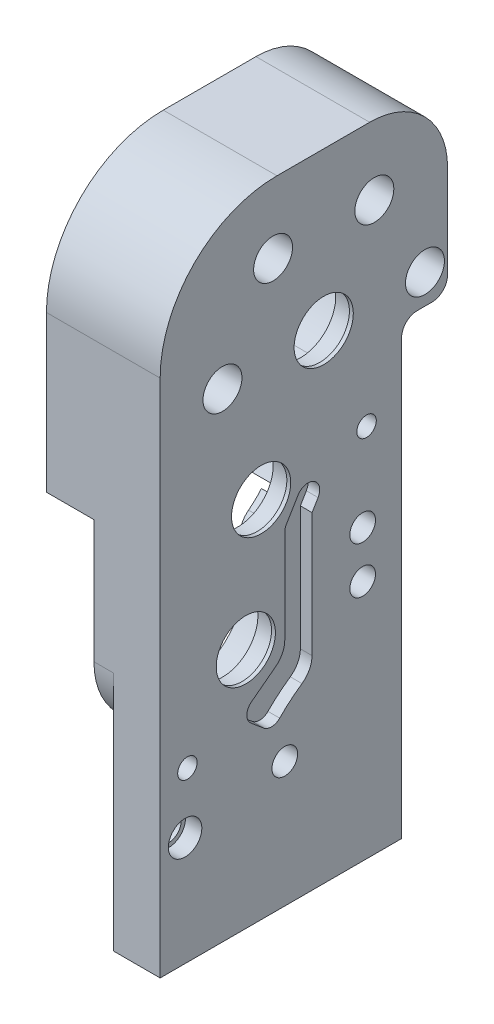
ISO-10303-21;
HEADER;
FILE_DESCRIPTION(('STEP AP214'),'2;1');
FILE_NAME('part.step','',(''),(''),'','','');
FILE_SCHEMA(('AUTOMOTIVE_DESIGN { 1 0 10303 214 1 1 1 1 }'));
ENDSEC;
DATA;
#1=APPLICATION_CONTEXT('core data for automotive mechanical design processes');
#2=APPLICATION_PROTOCOL_DEFINITION('international standard','automotive_design',2000,#1);
#3=PRODUCT_CONTEXT('',#1,'mechanical');
#4=PRODUCT('Part','Part','',(#3));
#5=PRODUCT_RELATED_PRODUCT_CATEGORY('part','',(#4));
#6=PRODUCT_DEFINITION_FORMATION('','',#4);
#7=PRODUCT_DEFINITION_CONTEXT('part definition',#1,'design');
#8=PRODUCT_DEFINITION('design','',#6,#7);
#9=PRODUCT_DEFINITION_SHAPE('','',#8);
#10=(LENGTH_UNIT() NAMED_UNIT(*) SI_UNIT(.MILLI.,.METRE.));
#11=(NAMED_UNIT(*) PLANE_ANGLE_UNIT() SI_UNIT($,.RADIAN.));
#12=(NAMED_UNIT(*) SI_UNIT($,.STERADIAN.) SOLID_ANGLE_UNIT());
#13=UNCERTAINTY_MEASURE_WITH_UNIT(LENGTH_MEASURE(1.E-05),#10,'distance_accuracy_value','');
#14=(GEOMETRIC_REPRESENTATION_CONTEXT(3) GLOBAL_UNCERTAINTY_ASSIGNED_CONTEXT((#13)) GLOBAL_UNIT_ASSIGNED_CONTEXT((#10,
#11,#12)) REPRESENTATION_CONTEXT('',''));
#15=CARTESIAN_POINT('',(0.,0.,0.));
#16=DIRECTION('',(0.,0.,1.));
#17=DIRECTION('',(1.,0.,0.));
#18=AXIS2_PLACEMENT_3D('',#15,#16,#17);
#19=CARTESIAN_POINT('',(0.,72.7583302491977,0.999999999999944));
#20=DIRECTION('',(-1.,0.,0.));
#21=DIRECTION('',(0.,0.,1.));
#22=AXIS2_PLACEMENT_3D('',#19,#20,#21);
#23=CYLINDRICAL_SURFACE('',#22,1.12499999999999);
#24=CARTESIAN_POINT('',(-14.6,72.7583302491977,0.999999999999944));
#25=DIRECTION('',(-1.,0.,0.));
#26=DIRECTION('',(0.,0.,1.));
#27=AXIS2_PLACEMENT_3D('',#24,#25,#26);
#28=CIRCLE('',#27,1.12499999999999);
#29=CARTESIAN_POINT('',(-14.6,72.7583302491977,2.12499999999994));
#30=VERTEX_POINT('',#29);
#31=EDGE_CURVE('E785',#30,#30,#28,.T.);
#32=ORIENTED_EDGE('',*,*,#31,.T.);
#33=EDGE_LOOP('',(#32));
#34=FACE_BOUND('',#33,.T.);
#35=CARTESIAN_POINT('',(-8.,72.7583302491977,0.999999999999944));
#36=DIRECTION('',(1.,0.,0.));
#37=DIRECTION('',(0.,0.,-1.));
#38=AXIS2_PLACEMENT_3D('',#35,#36,#37);
#39=CIRCLE('',#38,1.12499999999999);
#40=CARTESIAN_POINT('',(-8.,72.7583302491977,-0.12500000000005));
#41=VERTEX_POINT('',#40);
#42=EDGE_CURVE('E42',#41,#41,#39,.F.);
#43=ORIENTED_EDGE('',*,*,#42,.F.);
#44=EDGE_LOOP('',(#43));
#45=FACE_BOUND('',#44,.T.);
#46=ADVANCED_FACE('F38',(#34,#45),#23,.F.);
#47=CARTESIAN_POINT('',(0.,61.5,7.5));
#48=DIRECTION('',(-1.,0.,0.));
#49=DIRECTION('',(0.,0.,1.));
#50=AXIS2_PLACEMENT_3D('',#47,#48,#49);
#51=CYLINDRICAL_SURFACE('',#50,1.125);
#52=CARTESIAN_POINT('',(-14.6,61.5,7.5));
#53=DIRECTION('',(-1.,0.,0.));
#54=DIRECTION('',(0.,0.,1.));
#55=AXIS2_PLACEMENT_3D('',#52,#53,#54);
#56=CIRCLE('',#55,1.125);
#57=CARTESIAN_POINT('',(-14.6,61.5,8.62499999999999));
#58=VERTEX_POINT('',#57);
#59=EDGE_CURVE('E806',#58,#58,#56,.T.);
#60=ORIENTED_EDGE('',*,*,#59,.T.);
#61=EDGE_LOOP('',(#60));
#62=FACE_BOUND('',#61,.T.);
#63=CARTESIAN_POINT('',(-8.,61.5,7.5));
#64=DIRECTION('',(1.,0.,0.));
#65=DIRECTION('',(0.,0.,-1.));
#66=AXIS2_PLACEMENT_3D('',#63,#64,#65);
#67=CIRCLE('',#66,1.125);
#68=CARTESIAN_POINT('',(-8.,61.5,6.375));
#69=VERTEX_POINT('',#68);
#70=EDGE_CURVE('E792',#69,#69,#67,.F.);
#71=ORIENTED_EDGE('',*,*,#70,.F.);
#72=EDGE_LOOP('',(#71));
#73=FACE_BOUND('',#72,.T.);
#74=ADVANCED_FACE('F897',(#62,#73),#51,.F.);
#75=CARTESIAN_POINT('',(0.,72.7583302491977,-12.0000000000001));
#76=DIRECTION('',(-1.,0.,0.));
#77=DIRECTION('',(0.,0.,1.));
#78=AXIS2_PLACEMENT_3D('',#75,#76,#77);
#79=CYLINDRICAL_SURFACE('',#78,1.12499999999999);
#80=CARTESIAN_POINT('',(-14.6,72.7583302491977,-12.0000000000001));
#81=DIRECTION('',(-1.,0.,0.));
#82=DIRECTION('',(0.,0.,1.));
#83=AXIS2_PLACEMENT_3D('',#80,#81,#82);
#84=CIRCLE('',#83,1.12499999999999);
#85=CARTESIAN_POINT('',(-14.6,72.7583302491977,-10.8750000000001));
#86=VERTEX_POINT('',#85);
#87=EDGE_CURVE('E801',#86,#86,#84,.T.);
#88=ORIENTED_EDGE('',*,*,#87,.T.);
#89=EDGE_LOOP('',(#88));
#90=FACE_BOUND('',#89,.T.);
#91=CARTESIAN_POINT('',(-8.,72.7583302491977,-12.0000000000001));
#92=DIRECTION('',(1.,0.,0.));
#93=DIRECTION('',(0.,0.,-1.));
#94=AXIS2_PLACEMENT_3D('',#91,#92,#93);
#95=CIRCLE('',#94,1.12499999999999);
#96=CARTESIAN_POINT('',(-8.,72.7583302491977,-13.1250000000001));
#97=VERTEX_POINT('',#96);
#98=EDGE_CURVE('E789',#97,#97,#95,.F.);
#99=ORIENTED_EDGE('',*,*,#98,.F.);
#100=EDGE_LOOP('',(#99));
#101=FACE_BOUND('',#100,.T.);
#102=ADVANCED_FACE('F903',(#90,#101),#79,.F.);
#103=CARTESIAN_POINT('',(0.,61.5,-18.5));
#104=DIRECTION('',(-1.,0.,0.));
#105=DIRECTION('',(0.,0.,1.));
#106=AXIS2_PLACEMENT_3D('',#103,#104,#105);
#107=CYLINDRICAL_SURFACE('',#106,1.125);
#108=CARTESIAN_POINT('',(-14.6,61.5,-18.5));
#109=DIRECTION('',(-1.,0.,0.));
#110=DIRECTION('',(0.,0.,1.));
#111=AXIS2_PLACEMENT_3D('',#108,#109,#110);
#112=CIRCLE('',#111,1.125);
#113=CARTESIAN_POINT('',(-14.6,61.5,-17.375));
#114=VERTEX_POINT('',#113);
#115=EDGE_CURVE('E797',#114,#114,#112,.T.);
#116=ORIENTED_EDGE('',*,*,#115,.T.);
#117=EDGE_LOOP('',(#116));
#118=FACE_BOUND('',#117,.T.);
#119=CARTESIAN_POINT('',(-8.,61.5,-18.5));
#120=DIRECTION('',(1.,0.,0.));
#121=DIRECTION('',(0.,0.,-1.));
#122=AXIS2_PLACEMENT_3D('',#119,#120,#121);
#123=CIRCLE('',#122,1.125);
#124=CARTESIAN_POINT('',(-8.,61.5,-19.625));
#125=VERTEX_POINT('',#124);
#126=EDGE_CURVE('E786',#125,#125,#123,.F.);
#127=ORIENTED_EDGE('',*,*,#126,.F.);
#128=EDGE_LOOP('',(#127));
#129=FACE_BOUND('',#128,.T.);
#130=ADVANCED_FACE('F823',(#118,#129),#107,.F.);
#131=CARTESIAN_POINT('',(0.,71.7,-11.4));
#132=DIRECTION('',(-1.,0.,0.));
#133=DIRECTION('',(0.,0.,1.));
#134=AXIS2_PLACEMENT_3D('',#131,#132,#133);
#135=PLANE('',#134);
#136=CARTESIAN_POINT('',(0.,61.5,-18.5));
#137=DIRECTION('',(1.,0.,0.));
#138=DIRECTION('',(0.,0.,-1.));
#139=AXIS2_PLACEMENT_3D('',#136,#137,#138);
#140=CIRCLE('',#139,2.5);
#141=CARTESIAN_POINT('',(0.,61.5,-21.));
#142=VERTEX_POINT('',#141);
#143=EDGE_CURVE('E1849',#142,#142,#140,.T.);
#144=ORIENTED_EDGE('',*,*,#143,.F.);
#145=EDGE_LOOP('',(#144));
#146=FACE_BOUND('',#145,.T.);
#147=CARTESIAN_POINT('',(0.,72.7583302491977,-12.0000000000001));
#148=DIRECTION('',(1.,0.,0.));
#149=DIRECTION('',(0.,0.,-1.));
#150=AXIS2_PLACEMENT_3D('',#147,#148,#149);
#151=CIRCLE('',#150,2.5);
#152=CARTESIAN_POINT('',(0.,72.7583302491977,-14.5000000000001));
#153=VERTEX_POINT('',#152);
#154=EDGE_CURVE('E1855',#153,#153,#151,.T.);
#155=ORIENTED_EDGE('',*,*,#154,.F.);
#156=EDGE_LOOP('',(#155));
#157=FACE_BOUND('',#156,.T.);
#158=CARTESIAN_POINT('',(0.,61.5,7.5));
#159=DIRECTION('',(1.,0.,0.));
#160=DIRECTION('',(0.,0.,-1.));
#161=AXIS2_PLACEMENT_3D('',#158,#159,#160);
#162=CIRCLE('',#161,2.5);
#163=CARTESIAN_POINT('',(0.,61.5,5.));
#164=VERTEX_POINT('',#163);
#165=EDGE_CURVE('E1733',#164,#164,#162,.T.);
#166=ORIENTED_EDGE('',*,*,#165,.F.);
#167=EDGE_LOOP('',(#166));
#168=FACE_BOUND('',#167,.T.);
#169=CARTESIAN_POINT('',(0.,72.7583302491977,0.999999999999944));
#170=DIRECTION('',(1.,0.,0.));
#171=DIRECTION('',(0.,0.,-1.));
#172=AXIS2_PLACEMENT_3D('',#169,#170,#171);
#173=CIRCLE('',#172,2.5);
#174=CARTESIAN_POINT('',(0.,72.7583302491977,-1.50000000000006));
#175=VERTEX_POINT('',#174);
#176=EDGE_CURVE('E1727',#175,#175,#173,.T.);
#177=ORIENTED_EDGE('',*,*,#176,.F.);
#178=EDGE_LOOP('',(#177));
#179=FACE_BOUND('',#178,.T.);
#180=CARTESIAN_POINT('',(0.,48.1,-11.));
#181=DIRECTION('',(-1.,0.,0.));
#182=DIRECTION('',(0.,0.,1.));
#183=AXIS2_PLACEMENT_3D('',#180,#181,#182);
#184=CIRCLE('',#183,1.25);
#185=CARTESIAN_POINT('',(0.,48.1,-9.75));
#186=VERTEX_POINT('',#185);
#187=EDGE_CURVE('E370',#186,#186,#184,.F.);
#188=ORIENTED_EDGE('',*,*,#187,.F.);
#189=EDGE_LOOP('',(#188));
#190=FACE_BOUND('',#189,.T.);
#191=DIRECTION('',(0.,0.,-1.));
#192=VECTOR('',#191,1.);
#193=CARTESIAN_POINT('',(0.,57.7,-21.4));
#194=LINE('',#193,#192);
#195=CARTESIAN_POINT('',(0.,57.7,-17.5));
#196=VERTEX_POINT('',#195);
#197=CARTESIAN_POINT('',(0.,57.7,-19.4));
#198=VERTEX_POINT('',#197);
#199=EDGE_CURVE('E668',#196,#198,#194,.T.);
#200=ORIENTED_EDGE('',*,*,#199,.T.);
#201=CARTESIAN_POINT('',(0.,59.7,-19.4));
#202=DIRECTION('',(-1.,0.,0.));
#203=DIRECTION('',(0.,0.,1.));
#204=AXIS2_PLACEMENT_3D('',#201,#202,#203);
#205=CIRCLE('',#204,2.);
#206=CARTESIAN_POINT('',(0.,59.7,-21.4));
#207=VERTEX_POINT('',#206);
#208=EDGE_CURVE('E705',#198,#207,#205,.F.);
#209=ORIENTED_EDGE('',*,*,#208,.T.);
#210=DIRECTION('',(0.,1.,0.));
#211=VECTOR('',#210,1.);
#212=CARTESIAN_POINT('',(0.,57.7,-21.4));
#213=LINE('',#212,#211);
#214=CARTESIAN_POINT('',(0.,71.7,-21.4));
#215=VERTEX_POINT('',#214);
#216=EDGE_CURVE('E671',#207,#215,#213,.T.);
#217=ORIENTED_EDGE('',*,*,#216,.T.);
#218=CARTESIAN_POINT('',(0.,71.7,-11.4));
#219=DIRECTION('',(1.,0.,0.));
#220=DIRECTION('',(0.,0.,1.));
#221=AXIS2_PLACEMENT_3D('',#218,#219,#220);
#222=CIRCLE('',#221,10.);
#223=CARTESIAN_POINT('',(0.,81.7,-11.4));
#224=VERTEX_POINT('',#223);
#225=EDGE_CURVE('E673',#215,#224,#222,.T.);
#226=ORIENTED_EDGE('',*,*,#225,.T.);
#227=DIRECTION('',(0.,0.,1.));
#228=VECTOR('',#227,1.);
#229=CARTESIAN_POINT('',(0.,81.7,-11.4));
#230=LINE('',#229,#228);
#231=CARTESIAN_POINT('',(0.,81.7,0.500000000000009));
#232=VERTEX_POINT('',#231);
#233=EDGE_CURVE('E676',#224,#232,#230,.T.);
#234=ORIENTED_EDGE('',*,*,#233,.T.);
#235=CARTESIAN_POINT('',(0.,66.7,0.500000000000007));
#236=DIRECTION('',(1.,0.,0.));
#237=DIRECTION('',(0.,0.,-1.));
#238=AXIS2_PLACEMENT_3D('',#235,#236,#237);
#239=CIRCLE('',#238,15.);
#240=CARTESIAN_POINT('',(0.,66.7,15.5));
#241=VERTEX_POINT('',#240);
#242=EDGE_CURVE('E679',#232,#241,#239,.T.);
#243=ORIENTED_EDGE('',*,*,#242,.T.);
#244=DIRECTION('',(0.,-1.,0.));
#245=VECTOR('',#244,1.);
#246=CARTESIAN_POINT('',(0.,40.,15.5));
#247=LINE('',#246,#245);
#248=CARTESIAN_POINT('',(0.,0.,15.5));
#249=VERTEX_POINT('',#248);
#250=EDGE_CURVE('E657',#241,#249,#247,.T.);
#251=ORIENTED_EDGE('',*,*,#250,.T.);
#252=DIRECTION('',(0.,0.,-1.));
#253=VECTOR('',#252,1.);
#254=CARTESIAN_POINT('',(0.,0.,0.));
#255=LINE('',#254,#253);
#256=CARTESIAN_POINT('',(0.,0.,-15.5));
#257=VERTEX_POINT('',#256);
#258=EDGE_CURVE('E653',#249,#257,#255,.T.);
#259=ORIENTED_EDGE('',*,*,#258,.T.);
#260=DIRECTION('',(0.,1.,0.));
#261=VECTOR('',#260,1.);
#262=CARTESIAN_POINT('',(0.,0.,-15.5));
#263=LINE('',#262,#261);
#264=CARTESIAN_POINT('',(0.,55.7,-15.5));
#265=VERTEX_POINT('',#264);
#266=EDGE_CURVE('E665',#257,#265,#263,.T.);
#267=ORIENTED_EDGE('',*,*,#266,.T.);
#268=CARTESIAN_POINT('',(0.,55.7,-17.5));
#269=DIRECTION('',(-1.,0.,0.));
#270=DIRECTION('',(0.,0.,1.));
#271=AXIS2_PLACEMENT_3D('',#268,#269,#270);
#272=CIRCLE('',#271,2.);
#273=EDGE_CURVE('E714',#265,#196,#272,.T.);
#274=ORIENTED_EDGE('',*,*,#273,.T.);
#275=EDGE_LOOP('',(#200,#209,#217,#226,#234,#243,#251,#259,#267,#274));
#276=FACE_BOUND('',#275,.T.);
#277=CARTESIAN_POINT('',(0.,31.,4.50000000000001));
#278=DIRECTION('',(1.,0.,0.));
#279=DIRECTION('',(0.,0.,-1.));
#280=AXIS2_PLACEMENT_3D('',#277,#278,#279);
#281=CIRCLE('',#280,3.8);
#282=CARTESIAN_POINT('',(0.,31.,0.700000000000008));
#283=VERTEX_POINT('',#282);
#284=EDGE_CURVE('E647',#283,#283,#281,.T.);
#285=ORIENTED_EDGE('',*,*,#284,.F.);
#286=EDGE_LOOP('',(#285));
#287=FACE_BOUND('',#286,.T.);
#288=CARTESIAN_POINT('',(0.,61.5,-5.5));
#289=DIRECTION('',(1.,0.,0.));
#290=DIRECTION('',(0.,0.,-1.));
#291=AXIS2_PLACEMENT_3D('',#288,#289,#290);
#292=CIRCLE('',#291,3.8);
#293=CARTESIAN_POINT('',(0.,61.5,-9.3));
#294=VERTEX_POINT('',#293);
#295=EDGE_CURVE('E648',#294,#294,#292,.T.);
#296=ORIENTED_EDGE('',*,*,#295,.F.);
#297=EDGE_LOOP('',(#296));
#298=FACE_BOUND('',#297,.T.);
#299=CARTESIAN_POINT('',(0.,14.,12.3));
#300=DIRECTION('',(1.,0.,0.));
#301=DIRECTION('',(0.,0.,-1.));
#302=AXIS2_PLACEMENT_3D('',#299,#300,#301);
#303=CIRCLE('',#302,2.15);
#304=CARTESIAN_POINT('',(0.,14.,10.15));
#305=VERTEX_POINT('',#304);
#306=EDGE_CURVE('E629',#305,#305,#303,.T.);
#307=ORIENTED_EDGE('',*,*,#306,.F.);
#308=EDGE_LOOP('',(#307));
#309=FACE_BOUND('',#308,.T.);
#310=CARTESIAN_POINT('',(0.,46.7128151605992,2.53666998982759));
#311=DIRECTION('',(-1.,0.,0.));
#312=DIRECTION('',(0.,0.,1.));
#313=AXIS2_PLACEMENT_3D('',#310,#311,#312);
#314=CIRCLE('',#313,3.8);
#315=CARTESIAN_POINT('',(0.,46.7128151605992,6.33666998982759));
#316=VERTEX_POINT('',#315);
#317=EDGE_CURVE('E622',#316,#316,#314,.F.);
#318=ORIENTED_EDGE('',*,*,#317,.F.);
#319=EDGE_LOOP('',(#318));
#320=FACE_BOUND('',#319,.T.);
#321=CARTESIAN_POINT('',(0.,37.1,-10.5));
#322=DIRECTION('',(1.,0.,0.));
#323=DIRECTION('',(0.,0.,-1.));
#324=AXIS2_PLACEMENT_3D('',#321,#322,#323);
#325=CIRCLE('',#324,1.65);
#326=CARTESIAN_POINT('',(0.,37.1,-12.15));
#327=VERTEX_POINT('',#326);
#328=EDGE_CURVE('E514',#327,#327,#325,.T.);
#329=ORIENTED_EDGE('',*,*,#328,.F.);
#330=EDGE_LOOP('',(#329));
#331=FACE_BOUND('',#330,.T.);
#332=CARTESIAN_POINT('',(0.,31.1,-10.5));
#333=DIRECTION('',(1.,0.,0.));
#334=DIRECTION('',(0.,0.,-1.));
#335=AXIS2_PLACEMENT_3D('',#332,#333,#334);
#336=CIRCLE('',#335,1.65);
#337=CARTESIAN_POINT('',(0.,31.1,-12.15));
#338=VERTEX_POINT('',#337);
#339=EDGE_CURVE('E515',#338,#338,#336,.T.);
#340=ORIENTED_EDGE('',*,*,#339,.F.);
#341=EDGE_LOOP('',(#340));
#342=FACE_BOUND('',#341,.T.);
#343=CARTESIAN_POINT('',(0.,16.1,-0.500000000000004));
#344=DIRECTION('',(1.,0.,0.));
#345=DIRECTION('',(0.,0.,-1.));
#346=AXIS2_PLACEMENT_3D('',#343,#344,#345);
#347=CIRCLE('',#346,1.65);
#348=CARTESIAN_POINT('',(0.,16.1,-2.15));
#349=VERTEX_POINT('',#348);
#350=EDGE_CURVE('E410',#349,#349,#347,.T.);
#351=ORIENTED_EDGE('',*,*,#350,.F.);
#352=EDGE_LOOP('',(#351));
#353=FACE_BOUND('',#352,.T.);
#354=CARTESIAN_POINT('',(0.,21.6,12.));
#355=DIRECTION('',(1.,0.,0.));
#356=DIRECTION('',(0.,0.,-1.));
#357=AXIS2_PLACEMENT_3D('',#354,#355,#356);
#358=CIRCLE('',#357,1.25);
#359=CARTESIAN_POINT('',(0.,21.6,10.75));
#360=VERTEX_POINT('',#359);
#361=EDGE_CURVE('E416',#360,#360,#358,.T.);
#362=ORIENTED_EDGE('',*,*,#361,.F.);
#363=EDGE_LOOP('',(#362));
#364=FACE_BOUND('',#363,.T.);
#365=CARTESIAN_POINT('',(0.,29.5870583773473,2.49999999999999));
#366=DIRECTION('',(1.,0.,0.));
#367=DIRECTION('',(0.,0.,-1.));
#368=AXIS2_PLACEMENT_3D('',#365,#366,#367);
#369=CIRCLE('',#368,3.);
#370=CARTESIAN_POINT('',(0.,27.1995610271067,0.683449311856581));
#371=VERTEX_POINT('',#370);
#372=CARTESIAN_POINT('',(0.,29.5870583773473,-0.5));
#373=VERTEX_POINT('',#372);
#374=EDGE_CURVE('E357',#371,#373,#369,.T.);
#375=ORIENTED_EDGE('',*,*,#374,.T.);
#376=DIRECTION('',(0.,1.,0.));
#377=VECTOR('',#376,1.);
#378=CARTESIAN_POINT('',(0.,0.,-0.500000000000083));
#379=LINE('',#378,#377);
#380=CARTESIAN_POINT('',(0.,41.583974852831,-0.499999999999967));
#381=VERTEX_POINT('',#380);
#382=EDGE_CURVE('E364',#373,#381,#379,.T.);
#383=ORIENTED_EDGE('',*,*,#382,.T.);
#384=CARTESIAN_POINT('',(0.,41.583974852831,-1.99999999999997));
#385=DIRECTION('',(-1.,0.,0.));
#386=DIRECTION('',(0.,0.,1.));
#387=AXIS2_PLACEMENT_3D('',#384,#385,#386);
#388=CIRCLE('',#387,1.5);
#389=CARTESIAN_POINT('',(0.,42.3565929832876,-0.714285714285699));
#390=VERTEX_POINT('',#389);
#391=EDGE_CURVE('E774',#381,#390,#388,.T.);
#392=ORIENTED_EDGE('',*,*,#391,.T.);
#393=DIRECTION('',(0.,0.857142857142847,-0.515078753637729));
#394=VECTOR('',#393,1.);
#395=CARTESIAN_POINT('',(0.,10.9221091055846,18.1754881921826));
#396=LINE('',#395,#394);
#397=CARTESIAN_POINT('',(0.,44.8309505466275,-2.20118955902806));
#398=VERTEX_POINT('',#397);
#399=EDGE_CURVE('E367',#390,#398,#396,.T.);
#400=ORIENTED_EDGE('',*,*,#399,.T.);
#401=CARTESIAN_POINT('',(0.,44.0583324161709,-3.48690384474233));
#402=DIRECTION('',(-1.,0.,0.));
#403=DIRECTION('',(0.,0.,1.));
#404=AXIS2_PLACEMENT_3D('',#401,#402,#403);
#405=CIRCLE('',#404,1.5);
#406=CARTESIAN_POINT('',(0.,45.3440467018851,-4.25952197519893));
#407=VERTEX_POINT('',#406);
#408=EDGE_CURVE('E12',#398,#407,#405,.T.);
#409=ORIENTED_EDGE('',*,*,#408,.T.);
#410=CARTESIAN_POINT('',(0.,44.0583324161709,-3.48690384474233));
#411=DIRECTION('',(-1.,0.,0.));
#412=DIRECTION('',(0.,0.,1.));
#413=AXIS2_PLACEMENT_3D('',#410,#411,#412);
#414=CIRCLE('',#413,1.5);
#415=CARTESIAN_POINT('',(0.,43.2857142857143,-4.7726181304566));
#416=VERTEX_POINT('',#415);
#417=EDGE_CURVE('E47',#407,#416,#414,.T.);
#418=ORIENTED_EDGE('',*,*,#417,.T.);
#419=DIRECTION('',(0.,0.857142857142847,-0.51507875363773));
#420=VECTOR('',#419,1.);
#421=CARTESIAN_POINT('',(0.,9.3768728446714,15.604059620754));
#422=LINE('',#421,#420);
#423=CARTESIAN_POINT('',(0.,42.,-4.));
#424=VERTEX_POINT('',#423);
#425=EDGE_CURVE('E405',#424,#416,#422,.T.);
#426=ORIENTED_EDGE('',*,*,#425,.F.);
#427=DIRECTION('',(0.,-1.,0.));
#428=VECTOR('',#427,1.);
#429=CARTESIAN_POINT('',(0.,0.,-4.));
#430=LINE('',#429,#428);
#431=CARTESIAN_POINT('',(0.,26.1,-4.));
#432=VERTEX_POINT('',#431);
#433=EDGE_CURVE('E402',#424,#432,#430,.T.);
#434=ORIENTED_EDGE('',*,*,#433,.T.);
#435=CARTESIAN_POINT('',(0.,26.1,-1.));
#436=DIRECTION('',(1.,0.,0.));
#437=DIRECTION('',(0.,0.,-1.));
#438=AXIS2_PLACEMENT_3D('',#435,#436,#437);
#439=CIRCLE('',#438,3.);
#440=CARTESIAN_POINT('',(0.,23.6335393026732,-2.70779730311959));
#441=VERTEX_POINT('',#440);
#442=EDGE_CURVE('E399',#441,#432,#439,.T.);
#443=ORIENTED_EDGE('',*,*,#442,.F.);
#444=CARTESIAN_POINT('',(0.,7.19046798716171,-14.0931126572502));
#445=DIRECTION('',(1.,0.,0.));
#446=DIRECTION('',(0.,0.,-1.));
#447=AXIS2_PLACEMENT_3D('',#444,#445,#446);
#448=CIRCLE('',#447,20.);
#449=CARTESIAN_POINT('',(0.,21.2239013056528,0.156896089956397));
#450=VERTEX_POINT('',#449);
#451=EDGE_CURVE('E396',#441,#450,#448,.T.);
#452=ORIENTED_EDGE('',*,*,#451,.T.);
#453=CARTESIAN_POINT('',(0.,22.2764088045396,1.22564674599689));
#454=DIRECTION('',(-1.,0.,0.));
#455=DIRECTION('',(0.,0.,1.));
#456=AXIS2_PLACEMENT_3D('',#453,#454,#455);
#457=CIRCLE('',#456,1.5);
#458=CARTESIAN_POINT('',(0.,21.1266791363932,2.18903747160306));
#459=VERTEX_POINT('',#458);
#460=EDGE_CURVE('E776',#450,#459,#457,.T.);
#461=ORIENTED_EDGE('',*,*,#460,.T.);
#462=DIRECTION('',(0.,-0.642260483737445,-0.766486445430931));
#463=VECTOR('',#462,1.);
#464=CARTESIAN_POINT('',(0.,11.334327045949,-9.49735042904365));
#465=LINE('',#464,#463);
#466=CARTESIAN_POINT('',(0.,22.5028649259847,3.83140498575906));
#467=VERTEX_POINT('',#466);
#468=EDGE_CURVE('E393',#467,#459,#465,.T.);
#469=ORIENTED_EDGE('',*,*,#468,.F.);
#470=CARTESIAN_POINT('',(0.,23.6525945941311,2.86801426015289));
#471=DIRECTION('',(-1.,0.,0.));
#472=DIRECTION('',(0.,0.,1.));
#473=AXIS2_PLACEMENT_3D('',#470,#471,#472);
#474=CIRCLE('',#473,1.5);
#475=CARTESIAN_POINT('',(0.,24.8463432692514,3.77628960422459));
#476=VERTEX_POINT('',#475);
#477=EDGE_CURVE('E778',#467,#476,#474,.T.);
#478=ORIENTED_EDGE('',*,*,#477,.T.);
#479=DIRECTION('',(0.,0.605516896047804,-0.795832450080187));
#480=VECTOR('',#479,1.);
#481=CARTESIAN_POINT('',(0.,17.5561700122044,13.3577835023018));
#482=LINE('',#481,#480);
#483=EDGE_CURVE('E391',#476,#371,#482,.T.);
#484=ORIENTED_EDGE('',*,*,#483,.T.);
#485=EDGE_LOOP('',(#375,#383,#392,#400,#409,#418,#426,#434,#443,#452,#461,#469,#478,#484));
#486=FACE_BOUND('',#485,.T.);
#487=ADVANCED_FACE('F819',(#146,#157,#168,#179,#190,#276,#287,#298,#309,#320,#331,#342,#353,
#364,#486),#135,.F.);
#488=CARTESIAN_POINT('',(12.8693434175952,46.7128151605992,2.53666998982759));
#489=DIRECTION('',(-1.,0.,0.));
#490=DIRECTION('',(0.,0.,1.));
#491=AXIS2_PLACEMENT_3D('',#488,#489,#490);
#492=CYLINDRICAL_SURFACE('',#491,4.55);
#493=CARTESIAN_POINT('',(-0.5,46.7128151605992,2.53666998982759));
#494=DIRECTION('',(-1.,0.,0.));
#495=DIRECTION('',(0.,0.,1.));
#496=AXIS2_PLACEMENT_3D('',#493,#494,#495);
#497=CIRCLE('',#496,4.55);
#498=CARTESIAN_POINT('',(-0.5,46.7128151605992,7.08666998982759));
#499=VERTEX_POINT('',#498);
#500=EDGE_CURVE('E531',#499,#499,#497,.F.);
#501=ORIENTED_EDGE('',*,*,#500,.T.);
#502=EDGE_LOOP('',(#501));
#503=FACE_BOUND('',#502,.T.);
#504=CARTESIAN_POINT('',(-3.,46.7128151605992,2.53666998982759));
#505=DIRECTION('',(-1.,0.,0.));
#506=DIRECTION('',(0.,0.,1.));
#507=AXIS2_PLACEMENT_3D('',#504,#505,#506);
#508=CIRCLE('',#507,4.55);
#509=CARTESIAN_POINT('',(-3.,46.7128151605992,7.08666998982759));
#510=VERTEX_POINT('',#509);
#511=EDGE_CURVE('E457',#510,#510,#508,.F.);
#512=ORIENTED_EDGE('',*,*,#511,.F.);
#513=EDGE_LOOP('',(#512));
#514=FACE_BOUND('',#513,.T.);
#515=ADVANCED_FACE('F822',(#503,#514),#492,.F.);
#516=CARTESIAN_POINT('',(12.8693434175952,61.5,-5.5));
#517=DIRECTION('',(-1.,0.,0.));
#518=DIRECTION('',(0.,0.,1.));
#519=AXIS2_PLACEMENT_3D('',#516,#517,#518);
#520=CYLINDRICAL_SURFACE('',#519,4.55);
#521=CARTESIAN_POINT('',(-0.5,61.5,-5.5));
#522=DIRECTION('',(-1.,0.,0.));
#523=DIRECTION('',(0.,0.,1.));
#524=AXIS2_PLACEMENT_3D('',#521,#522,#523);
#525=CIRCLE('',#524,4.55);
#526=CARTESIAN_POINT('',(-0.5,61.5,-0.950000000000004));
#527=VERTEX_POINT('',#526);
#528=EDGE_CURVE('E518',#527,#527,#525,.F.);
#529=ORIENTED_EDGE('',*,*,#528,.T.);
#530=EDGE_LOOP('',(#529));
#531=FACE_BOUND('',#530,.T.);
#532=CARTESIAN_POINT('',(-3.,61.5,-5.5));
#533=DIRECTION('',(-1.,0.,0.));
#534=DIRECTION('',(0.,0.,1.));
#535=AXIS2_PLACEMENT_3D('',#532,#533,#534);
#536=CIRCLE('',#535,4.55);
#537=CARTESIAN_POINT('',(-3.,61.5,-0.950000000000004));
#538=VERTEX_POINT('',#537);
#539=EDGE_CURVE('E454',#538,#538,#536,.F.);
#540=ORIENTED_EDGE('',*,*,#539,.F.);
#541=EDGE_LOOP('',(#540));
#542=FACE_BOUND('',#541,.T.);
#543=ADVANCED_FACE('F982',(#531,#542),#520,.F.);
#544=CARTESIAN_POINT('',(12.8693434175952,31.,4.50000000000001));
#545=DIRECTION('',(-1.,0.,0.));
#546=DIRECTION('',(0.,0.,1.));
#547=AXIS2_PLACEMENT_3D('',#544,#545,#546);
#548=CYLINDRICAL_SURFACE('',#547,4.55);
#549=CARTESIAN_POINT('',(-0.5,31.,4.50000000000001));
#550=DIRECTION('',(-1.,0.,0.));
#551=DIRECTION('',(0.,0.,1.));
#552=AXIS2_PLACEMENT_3D('',#549,#550,#551);
#553=CIRCLE('',#552,4.55);
#554=CARTESIAN_POINT('',(-0.5,31.,9.05000000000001));
#555=VERTEX_POINT('',#554);
#556=EDGE_CURVE('E527',#555,#555,#553,.F.);
#557=ORIENTED_EDGE('',*,*,#556,.T.);
#558=EDGE_LOOP('',(#557));
#559=FACE_BOUND('',#558,.T.);
#560=CARTESIAN_POINT('',(-3.,31.,4.50000000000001));
#561=DIRECTION('',(-1.,0.,0.));
#562=DIRECTION('',(0.,0.,1.));
#563=AXIS2_PLACEMENT_3D('',#560,#561,#562);
#564=CIRCLE('',#563,4.55);
#565=CARTESIAN_POINT('',(-3.,31.,9.05000000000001));
#566=VERTEX_POINT('',#565);
#567=EDGE_CURVE('E452',#566,#566,#564,.F.);
#568=ORIENTED_EDGE('',*,*,#567,.F.);
#569=EDGE_LOOP('',(#568));
#570=FACE_BOUND('',#569,.T.);
#571=ADVANCED_FACE('F978',(#559,#570),#548,.F.);
#572=CARTESIAN_POINT('',(-6.001,31.,4.50000000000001));
#573=DIRECTION('',(1.,0.,0.));
#574=DIRECTION('',(0.,0.,-1.));
#575=AXIS2_PLACEMENT_3D('',#572,#573,#574);
#576=CYLINDRICAL_SURFACE('',#575,3.8);
#577=CARTESIAN_POINT('',(-0.5,31.,4.50000000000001));
#578=DIRECTION('',(-1.,0.,0.));
#579=DIRECTION('',(0.,0.,1.));
#580=AXIS2_PLACEMENT_3D('',#577,#578,#579);
#581=CIRCLE('',#580,3.8);
#582=CARTESIAN_POINT('',(-0.499999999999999,31.,0.700000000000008));
#583=VERTEX_POINT('',#582);
#584=EDGE_CURVE('E555',#583,#583,#581,.F.);
#585=CARTESIAN_POINT('',(0.,31.,0.700000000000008));
#586=CARTESIAN_POINT('',(-0.00520833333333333,31.,0.700000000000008));
#587=CARTESIAN_POINT('',(-0.0104166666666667,31.,0.700000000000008));
#588=CARTESIAN_POINT('',(-0.0208333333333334,31.,0.700000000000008));
#589=CARTESIAN_POINT('',(-0.0260416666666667,31.,0.700000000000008));
#590=CARTESIAN_POINT('',(-0.0364583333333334,31.,0.700000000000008));
#591=CARTESIAN_POINT('',(-0.0416666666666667,31.,0.700000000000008));
#592=CARTESIAN_POINT('',(-0.0520833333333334,31.,0.700000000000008));
#593=CARTESIAN_POINT('',(-0.0572916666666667,31.,0.700000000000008));
#594=CARTESIAN_POINT('',(-0.0677083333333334,31.,0.700000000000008));
#595=CARTESIAN_POINT('',(-0.0729166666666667,31.,0.700000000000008));
#596=CARTESIAN_POINT('',(-0.0833333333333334,31.,0.700000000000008));
#597=CARTESIAN_POINT('',(-0.0885416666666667,31.,0.700000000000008));
#598=CARTESIAN_POINT('',(-0.0989583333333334,31.,0.700000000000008));
#599=CARTESIAN_POINT('',(-0.104166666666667,31.,0.700000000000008));
#600=CARTESIAN_POINT('',(-0.114583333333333,31.,0.700000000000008));
#601=CARTESIAN_POINT('',(-0.119791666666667,31.,0.700000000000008));
#602=CARTESIAN_POINT('',(-0.130208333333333,31.,0.700000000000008));
#603=CARTESIAN_POINT('',(-0.135416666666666,31.,0.700000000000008));
#604=CARTESIAN_POINT('',(-0.145833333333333,31.,0.700000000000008));
#605=CARTESIAN_POINT('',(-0.151041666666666,31.,0.700000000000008));
#606=CARTESIAN_POINT('',(-0.161458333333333,31.,0.700000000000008));
#607=CARTESIAN_POINT('',(-0.166666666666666,31.,0.700000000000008));
#608=CARTESIAN_POINT('',(-0.177083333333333,31.,0.700000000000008));
#609=CARTESIAN_POINT('',(-0.182291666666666,31.,0.700000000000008));
#610=CARTESIAN_POINT('',(-0.192708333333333,31.,0.700000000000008));
#611=CARTESIAN_POINT('',(-0.197916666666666,31.,0.700000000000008));
#612=CARTESIAN_POINT('',(-0.208333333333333,31.,0.700000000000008));
#613=CARTESIAN_POINT('',(-0.213541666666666,31.,0.700000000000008));
#614=CARTESIAN_POINT('',(-0.223958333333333,31.,0.700000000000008));
#615=CARTESIAN_POINT('',(-0.229166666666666,31.,0.700000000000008));
#616=CARTESIAN_POINT('',(-0.239583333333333,31.,0.700000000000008));
#617=CARTESIAN_POINT('',(-0.244791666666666,31.,0.700000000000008));
#618=CARTESIAN_POINT('',(-0.255208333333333,31.,0.700000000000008));
#619=CARTESIAN_POINT('',(-0.260416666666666,31.,0.700000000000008));
#620=CARTESIAN_POINT('',(-0.270833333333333,31.,0.700000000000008));
#621=CARTESIAN_POINT('',(-0.276041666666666,31.,0.700000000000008));
#622=CARTESIAN_POINT('',(-0.286458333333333,31.,0.700000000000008));
#623=CARTESIAN_POINT('',(-0.291666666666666,31.,0.700000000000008));
#624=CARTESIAN_POINT('',(-0.302083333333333,31.,0.700000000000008));
#625=CARTESIAN_POINT('',(-0.307291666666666,31.,0.700000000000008));
#626=CARTESIAN_POINT('',(-0.317708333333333,31.,0.700000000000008));
#627=CARTESIAN_POINT('',(-0.322916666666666,31.,0.700000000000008));
#628=CARTESIAN_POINT('',(-0.333333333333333,31.,0.700000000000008));
#629=CARTESIAN_POINT('',(-0.338541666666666,31.,0.700000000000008));
#630=CARTESIAN_POINT('',(-0.348958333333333,31.,0.700000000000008));
#631=CARTESIAN_POINT('',(-0.354166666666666,31.,0.700000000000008));
#632=CARTESIAN_POINT('',(-0.364583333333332,31.,0.700000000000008));
#633=CARTESIAN_POINT('',(-0.369791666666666,31.,0.700000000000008));
#634=CARTESIAN_POINT('',(-0.380208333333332,31.,0.700000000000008));
#635=CARTESIAN_POINT('',(-0.385416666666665,31.,0.700000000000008));
#636=CARTESIAN_POINT('',(-0.395833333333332,31.,0.700000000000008));
#637=CARTESIAN_POINT('',(-0.401041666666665,31.,0.700000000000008));
#638=CARTESIAN_POINT('',(-0.411458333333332,31.,0.700000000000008));
#639=CARTESIAN_POINT('',(-0.416666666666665,31.,0.700000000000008));
#640=CARTESIAN_POINT('',(-0.427083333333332,31.,0.700000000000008));
#641=CARTESIAN_POINT('',(-0.432291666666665,31.,0.700000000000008));
#642=CARTESIAN_POINT('',(-0.442708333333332,31.,0.700000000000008));
#643=CARTESIAN_POINT('',(-0.447916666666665,31.,0.700000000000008));
#644=CARTESIAN_POINT('',(-0.458333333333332,31.,0.700000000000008));
#645=CARTESIAN_POINT('',(-0.463541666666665,31.,0.700000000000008));
#646=CARTESIAN_POINT('',(-0.473958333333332,31.,0.700000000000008));
#647=CARTESIAN_POINT('',(-0.479166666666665,31.,0.700000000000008));
#648=CARTESIAN_POINT('',(-0.489583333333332,31.,0.700000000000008));
#649=CARTESIAN_POINT('',(-0.494791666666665,31.,0.700000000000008));
#650=CARTESIAN_POINT('',(-0.499999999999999,31.,0.700000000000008));
#651=B_SPLINE_CURVE_WITH_KNOTS('',3,(#585,#586,#587,#588,#589,#590,#591,#592,#593,#594,#595,
#596,#597,#598,#599,#600,#601,#602,#603,#604,#605,#606,#607,#608,#609,#610,#611,#612,#613,#614,
#615,#616,#617,#618,#619,#620,#621,#622,#623,#624,#625,#626,#627,#628,#629,#630,#631,#632,#633,
#634,#635,#636,#637,#638,#639,#640,#641,#642,#643,#644,#645,#646,#647,#648,#649,#650),
.UNSPECIFIED.,.F.,.F.,(4,2,2,2,2,2,2,2,2,2,2,2,2,2,2,2,2,2,2,2,2,2,2,2,2,2,2,2,2,2,2,2,4),(0.,
0.015625,0.03125,0.046875,0.0625000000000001,0.0781250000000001,0.0937500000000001,0.109375,
0.125,0.140624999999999,0.156249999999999,0.171874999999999,0.187499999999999,0.203124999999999,
0.218749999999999,0.234374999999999,0.249999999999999,0.265624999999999,0.281249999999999,
0.296874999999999,0.312499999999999,0.328124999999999,0.343749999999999,0.359374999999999,
0.374999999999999,0.390624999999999,0.406249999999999,0.421874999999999,0.437499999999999,
0.453124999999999,0.468749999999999,0.484374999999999,0.499999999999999),.UNSPECIFIED.);
#652=EDGE_CURVE('BSEAM981',#283,#583,#651,.T.);
#653=ORIENTED_EDGE('',*,*,#284,.T.);
#654=ORIENTED_EDGE('',*,*,#584,.F.);
#655=ORIENTED_EDGE('',*,*,#652,.T.);
#656=ORIENTED_EDGE('',*,*,#652,.F.);
#657=EDGE_LOOP('',(#653,#655,#654,#656));
#658=FACE_BOUND('',#657,.T.);
#659=ADVANCED_FACE('F981',(#658),#576,.F.);
#660=CARTESIAN_POINT('',(-6.001,61.5,-5.5));
#661=DIRECTION('',(1.,0.,0.));
#662=DIRECTION('',(0.,0.,-1.));
#663=AXIS2_PLACEMENT_3D('',#660,#661,#662);
#664=CYLINDRICAL_SURFACE('',#663,3.8);
#665=CARTESIAN_POINT('',(-0.5,61.5,-5.5));
#666=DIRECTION('',(-1.,0.,0.));
#667=DIRECTION('',(0.,0.,1.));
#668=AXIS2_PLACEMENT_3D('',#665,#666,#667);
#669=CIRCLE('',#668,3.8);
#670=CARTESIAN_POINT('',(-0.499999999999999,61.5,-9.3));
#671=VERTEX_POINT('',#670);
#672=EDGE_CURVE('E739',#671,#671,#669,.F.);
#673=CARTESIAN_POINT('',(0.,61.5,-9.3));
#674=CARTESIAN_POINT('',(-0.00520833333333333,61.5,-9.3));
#675=CARTESIAN_POINT('',(-0.0104166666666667,61.5,-9.3));
#676=CARTESIAN_POINT('',(-0.0208333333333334,61.5,-9.3));
#677=CARTESIAN_POINT('',(-0.0260416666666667,61.5,-9.3));
#678=CARTESIAN_POINT('',(-0.0364583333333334,61.5,-9.3));
#679=CARTESIAN_POINT('',(-0.0416666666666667,61.5,-9.3));
#680=CARTESIAN_POINT('',(-0.0520833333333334,61.5,-9.3));
#681=CARTESIAN_POINT('',(-0.0572916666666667,61.5,-9.3));
#682=CARTESIAN_POINT('',(-0.0677083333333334,61.5,-9.3));
#683=CARTESIAN_POINT('',(-0.0729166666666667,61.5,-9.3));
#684=CARTESIAN_POINT('',(-0.0833333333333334,61.5,-9.3));
#685=CARTESIAN_POINT('',(-0.0885416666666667,61.5,-9.3));
#686=CARTESIAN_POINT('',(-0.0989583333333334,61.5,-9.3));
#687=CARTESIAN_POINT('',(-0.104166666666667,61.5,-9.3));
#688=CARTESIAN_POINT('',(-0.114583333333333,61.5,-9.3));
#689=CARTESIAN_POINT('',(-0.119791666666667,61.5,-9.3));
#690=CARTESIAN_POINT('',(-0.130208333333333,61.5,-9.3));
#691=CARTESIAN_POINT('',(-0.135416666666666,61.5,-9.3));
#692=CARTESIAN_POINT('',(-0.145833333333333,61.5,-9.3));
#693=CARTESIAN_POINT('',(-0.151041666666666,61.5,-9.3));
#694=CARTESIAN_POINT('',(-0.161458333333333,61.5,-9.3));
#695=CARTESIAN_POINT('',(-0.166666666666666,61.5,-9.3));
#696=CARTESIAN_POINT('',(-0.177083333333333,61.5,-9.3));
#697=CARTESIAN_POINT('',(-0.182291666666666,61.5,-9.3));
#698=CARTESIAN_POINT('',(-0.192708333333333,61.5,-9.3));
#699=CARTESIAN_POINT('',(-0.197916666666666,61.5,-9.3));
#700=CARTESIAN_POINT('',(-0.208333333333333,61.5,-9.3));
#701=CARTESIAN_POINT('',(-0.213541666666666,61.5,-9.3));
#702=CARTESIAN_POINT('',(-0.223958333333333,61.5,-9.3));
#703=CARTESIAN_POINT('',(-0.229166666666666,61.5,-9.3));
#704=CARTESIAN_POINT('',(-0.239583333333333,61.5,-9.3));
#705=CARTESIAN_POINT('',(-0.244791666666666,61.5,-9.3));
#706=CARTESIAN_POINT('',(-0.255208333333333,61.5,-9.3));
#707=CARTESIAN_POINT('',(-0.260416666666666,61.5,-9.3));
#708=CARTESIAN_POINT('',(-0.270833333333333,61.5,-9.3));
#709=CARTESIAN_POINT('',(-0.276041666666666,61.5,-9.3));
#710=CARTESIAN_POINT('',(-0.286458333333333,61.5,-9.3));
#711=CARTESIAN_POINT('',(-0.291666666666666,61.5,-9.3));
#712=CARTESIAN_POINT('',(-0.302083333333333,61.5,-9.3));
#713=CARTESIAN_POINT('',(-0.307291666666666,61.5,-9.3));
#714=CARTESIAN_POINT('',(-0.317708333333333,61.5,-9.3));
#715=CARTESIAN_POINT('',(-0.322916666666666,61.5,-9.3));
#716=CARTESIAN_POINT('',(-0.333333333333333,61.5,-9.3));
#717=CARTESIAN_POINT('',(-0.338541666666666,61.5,-9.3));
#718=CARTESIAN_POINT('',(-0.348958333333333,61.5,-9.3));
#719=CARTESIAN_POINT('',(-0.354166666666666,61.5,-9.3));
#720=CARTESIAN_POINT('',(-0.364583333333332,61.5,-9.3));
#721=CARTESIAN_POINT('',(-0.369791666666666,61.5,-9.3));
#722=CARTESIAN_POINT('',(-0.380208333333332,61.5,-9.3));
#723=CARTESIAN_POINT('',(-0.385416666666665,61.5,-9.3));
#724=CARTESIAN_POINT('',(-0.395833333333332,61.5,-9.3));
#725=CARTESIAN_POINT('',(-0.401041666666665,61.5,-9.3));
#726=CARTESIAN_POINT('',(-0.411458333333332,61.5,-9.3));
#727=CARTESIAN_POINT('',(-0.416666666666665,61.5,-9.3));
#728=CARTESIAN_POINT('',(-0.427083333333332,61.5,-9.3));
#729=CARTESIAN_POINT('',(-0.432291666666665,61.5,-9.3));
#730=CARTESIAN_POINT('',(-0.442708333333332,61.5,-9.3));
#731=CARTESIAN_POINT('',(-0.447916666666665,61.5,-9.3));
#732=CARTESIAN_POINT('',(-0.458333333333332,61.5,-9.3));
#733=CARTESIAN_POINT('',(-0.463541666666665,61.5,-9.3));
#734=CARTESIAN_POINT('',(-0.473958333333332,61.5,-9.3));
#735=CARTESIAN_POINT('',(-0.479166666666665,61.5,-9.3));
#736=CARTESIAN_POINT('',(-0.489583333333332,61.5,-9.3));
#737=CARTESIAN_POINT('',(-0.494791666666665,61.5,-9.3));
#738=CARTESIAN_POINT('',(-0.499999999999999,61.5,-9.3));
#739=B_SPLINE_CURVE_WITH_KNOTS('',3,(#673,#674,#675,#676,#677,#678,#679,#680,#681,#682,#683,
#684,#685,#686,#687,#688,#689,#690,#691,#692,#693,#694,#695,#696,#697,#698,#699,#700,#701,#702,
#703,#704,#705,#706,#707,#708,#709,#710,#711,#712,#713,#714,#715,#716,#717,#718,#719,#720,#721,
#722,#723,#724,#725,#726,#727,#728,#729,#730,#731,#732,#733,#734,#735,#736,#737,#738),
.UNSPECIFIED.,.F.,.F.,(4,2,2,2,2,2,2,2,2,2,2,2,2,2,2,2,2,2,2,2,2,2,2,2,2,2,2,2,2,2,2,2,4),(0.,
0.015625,0.03125,0.046875,0.0625000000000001,0.0781250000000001,0.0937500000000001,0.109375,
0.125,0.140624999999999,0.156249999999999,0.171874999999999,0.187499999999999,0.203124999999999,
0.218749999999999,0.234374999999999,0.249999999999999,0.265624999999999,0.281249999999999,
0.296874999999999,0.312499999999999,0.328124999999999,0.343749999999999,0.359374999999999,
0.374999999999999,0.390624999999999,0.406249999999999,0.421874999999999,0.437499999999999,
0.453124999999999,0.468749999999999,0.484374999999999,0.499999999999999),.UNSPECIFIED.);
#740=EDGE_CURVE('BSEAM1054',#294,#671,#739,.T.);
#741=ORIENTED_EDGE('',*,*,#295,.T.);
#742=ORIENTED_EDGE('',*,*,#672,.F.);
#743=ORIENTED_EDGE('',*,*,#740,.T.);
#744=ORIENTED_EDGE('',*,*,#740,.F.);
#745=EDGE_LOOP('',(#741,#743,#742,#744));
#746=FACE_BOUND('',#745,.T.);
#747=ADVANCED_FACE('F1054',(#746),#664,.F.);
#748=CARTESIAN_POINT('',(0.00100000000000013,46.7128151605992,2.53666998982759));
#749=DIRECTION('',(-1.,0.,0.));
#750=DIRECTION('',(0.,0.,1.));
#751=AXIS2_PLACEMENT_3D('',#748,#749,#750);
#752=CYLINDRICAL_SURFACE('',#751,3.8);
#753=CARTESIAN_POINT('',(-0.5,46.7128151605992,2.53666998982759));
#754=DIRECTION('',(-1.,0.,0.));
#755=DIRECTION('',(0.,0.,1.));
#756=AXIS2_PLACEMENT_3D('',#753,#754,#755);
#757=CIRCLE('',#756,3.8);
#758=CARTESIAN_POINT('',(-0.5,46.7128151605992,6.33666998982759));
#759=VERTEX_POINT('',#758);
#760=EDGE_CURVE('E530',#759,#759,#757,.F.);
#761=CARTESIAN_POINT('',(0.,46.7128151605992,6.33666998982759));
#762=CARTESIAN_POINT('',(-0.00520833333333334,46.7128151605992,6.33666998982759));
#763=CARTESIAN_POINT('',(-0.0104166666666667,46.7128151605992,6.33666998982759));
#764=CARTESIAN_POINT('',(-0.0208333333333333,46.7128151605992,6.33666998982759));
#765=CARTESIAN_POINT('',(-0.0260416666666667,46.7128151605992,6.33666998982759));
#766=CARTESIAN_POINT('',(-0.0364583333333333,46.7128151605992,6.33666998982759));
#767=CARTESIAN_POINT('',(-0.0416666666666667,46.7128151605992,6.33666998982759));
#768=CARTESIAN_POINT('',(-0.0520833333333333,46.7128151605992,6.33666998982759));
#769=CARTESIAN_POINT('',(-0.0572916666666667,46.7128151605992,6.33666998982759));
#770=CARTESIAN_POINT('',(-0.0677083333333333,46.7128151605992,6.33666998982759));
#771=CARTESIAN_POINT('',(-0.0729166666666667,46.7128151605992,6.33666998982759));
#772=CARTESIAN_POINT('',(-0.0833333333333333,46.7128151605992,6.33666998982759));
#773=CARTESIAN_POINT('',(-0.0885416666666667,46.7128151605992,6.33666998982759));
#774=CARTESIAN_POINT('',(-0.0989583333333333,46.7128151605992,6.33666998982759));
#775=CARTESIAN_POINT('',(-0.104166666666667,46.7128151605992,6.33666998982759));
#776=CARTESIAN_POINT('',(-0.114583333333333,46.7128151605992,6.33666998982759));
#777=CARTESIAN_POINT('',(-0.119791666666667,46.7128151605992,6.33666998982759));
#778=CARTESIAN_POINT('',(-0.130208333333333,46.7128151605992,6.33666998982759));
#779=CARTESIAN_POINT('',(-0.135416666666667,46.7128151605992,6.33666998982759));
#780=CARTESIAN_POINT('',(-0.145833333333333,46.7128151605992,6.33666998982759));
#781=CARTESIAN_POINT('',(-0.151041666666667,46.7128151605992,6.33666998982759));
#782=CARTESIAN_POINT('',(-0.161458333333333,46.7128151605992,6.33666998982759));
#783=CARTESIAN_POINT('',(-0.166666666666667,46.7128151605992,6.33666998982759));
#784=CARTESIAN_POINT('',(-0.177083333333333,46.7128151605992,6.33666998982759));
#785=CARTESIAN_POINT('',(-0.182291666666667,46.7128151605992,6.33666998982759));
#786=CARTESIAN_POINT('',(-0.192708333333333,46.7128151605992,6.33666998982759));
#787=CARTESIAN_POINT('',(-0.197916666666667,46.7128151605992,6.33666998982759));
#788=CARTESIAN_POINT('',(-0.208333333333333,46.7128151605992,6.33666998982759));
#789=CARTESIAN_POINT('',(-0.213541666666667,46.7128151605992,6.33666998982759));
#790=CARTESIAN_POINT('',(-0.223958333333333,46.7128151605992,6.33666998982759));
#791=CARTESIAN_POINT('',(-0.229166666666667,46.7128151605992,6.33666998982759));
#792=CARTESIAN_POINT('',(-0.239583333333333,46.7128151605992,6.33666998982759));
#793=CARTESIAN_POINT('',(-0.244791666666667,46.7128151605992,6.33666998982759));
#794=CARTESIAN_POINT('',(-0.255208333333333,46.7128151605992,6.33666998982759));
#795=CARTESIAN_POINT('',(-0.260416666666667,46.7128151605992,6.33666998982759));
#796=CARTESIAN_POINT('',(-0.270833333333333,46.7128151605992,6.33666998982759));
#797=CARTESIAN_POINT('',(-0.276041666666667,46.7128151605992,6.33666998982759));
#798=CARTESIAN_POINT('',(-0.286458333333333,46.7128151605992,6.33666998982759));
#799=CARTESIAN_POINT('',(-0.291666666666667,46.7128151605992,6.33666998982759));
#800=CARTESIAN_POINT('',(-0.302083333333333,46.7128151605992,6.33666998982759));
#801=CARTESIAN_POINT('',(-0.307291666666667,46.7128151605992,6.33666998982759));
#802=CARTESIAN_POINT('',(-0.317708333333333,46.7128151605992,6.33666998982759));
#803=CARTESIAN_POINT('',(-0.322916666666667,46.7128151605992,6.33666998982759));
#804=CARTESIAN_POINT('',(-0.333333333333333,46.7128151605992,6.33666998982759));
#805=CARTESIAN_POINT('',(-0.338541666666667,46.7128151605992,6.33666998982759));
#806=CARTESIAN_POINT('',(-0.348958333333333,46.7128151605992,6.33666998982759));
#807=CARTESIAN_POINT('',(-0.354166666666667,46.7128151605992,6.33666998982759));
#808=CARTESIAN_POINT('',(-0.364583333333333,46.7128151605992,6.33666998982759));
#809=CARTESIAN_POINT('',(-0.369791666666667,46.7128151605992,6.33666998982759));
#810=CARTESIAN_POINT('',(-0.380208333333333,46.7128151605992,6.33666998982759));
#811=CARTESIAN_POINT('',(-0.385416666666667,46.7128151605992,6.33666998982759));
#812=CARTESIAN_POINT('',(-0.395833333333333,46.7128151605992,6.33666998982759));
#813=CARTESIAN_POINT('',(-0.401041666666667,46.7128151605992,6.33666998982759));
#814=CARTESIAN_POINT('',(-0.411458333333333,46.7128151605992,6.33666998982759));
#815=CARTESIAN_POINT('',(-0.416666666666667,46.7128151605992,6.33666998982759));
#816=CARTESIAN_POINT('',(-0.427083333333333,46.7128151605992,6.33666998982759));
#817=CARTESIAN_POINT('',(-0.432291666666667,46.7128151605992,6.33666998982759));
#818=CARTESIAN_POINT('',(-0.442708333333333,46.7128151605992,6.33666998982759));
#819=CARTESIAN_POINT('',(-0.447916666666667,46.7128151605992,6.33666998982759));
#820=CARTESIAN_POINT('',(-0.458333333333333,46.7128151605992,6.33666998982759));
#821=CARTESIAN_POINT('',(-0.463541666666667,46.7128151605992,6.33666998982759));
#822=CARTESIAN_POINT('',(-0.473958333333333,46.7128151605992,6.33666998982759));
#823=CARTESIAN_POINT('',(-0.479166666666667,46.7128151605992,6.33666998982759));
#824=CARTESIAN_POINT('',(-0.489583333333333,46.7128151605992,6.33666998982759));
#825=CARTESIAN_POINT('',(-0.494791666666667,46.7128151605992,6.33666998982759));
#826=CARTESIAN_POINT('',(-0.5,46.7128151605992,6.33666998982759));
#827=B_SPLINE_CURVE_WITH_KNOTS('',3,(#761,#762,#763,#764,#765,#766,#767,#768,#769,#770,#771,
#772,#773,#774,#775,#776,#777,#778,#779,#780,#781,#782,#783,#784,#785,#786,#787,#788,#789,#790,
#791,#792,#793,#794,#795,#796,#797,#798,#799,#800,#801,#802,#803,#804,#805,#806,#807,#808,#809,
#810,#811,#812,#813,#814,#815,#816,#817,#818,#819,#820,#821,#822,#823,#824,#825,#826),
.UNSPECIFIED.,.F.,.F.,(4,2,2,2,2,2,2,2,2,2,2,2,2,2,2,2,2,2,2,2,2,2,2,2,2,2,2,2,2,2,2,2,4),(0.,
0.015625,0.03125,0.046875,0.0625,0.078125,0.09375,0.109375,0.125,0.140625,0.15625,0.171875,
0.1875,0.203125,0.21875,0.234375,0.25,0.265625,0.28125,0.296875,0.3125,0.328125,0.34375,
0.359375,0.375,0.390625,0.40625,0.421875,0.4375,0.453125,0.46875,0.484375,0.5),.UNSPECIFIED.);
#828=EDGE_CURVE('BSEAM1050',#316,#759,#827,.T.);
#829=ORIENTED_EDGE('',*,*,#317,.T.);
#830=ORIENTED_EDGE('',*,*,#760,.F.);
#831=ORIENTED_EDGE('',*,*,#828,.T.);
#832=ORIENTED_EDGE('',*,*,#828,.F.);
#833=EDGE_LOOP('',(#829,#831,#830,#832));
#834=FACE_BOUND('',#833,.T.);
#835=ADVANCED_FACE('F1050',(#834),#752,.F.);
#836=CARTESIAN_POINT('',(-6.001,14.,12.3));
#837=DIRECTION('',(1.,0.,0.));
#838=DIRECTION('',(0.,0.,-1.));
#839=AXIS2_PLACEMENT_3D('',#836,#837,#838);
#840=CYLINDRICAL_SURFACE('',#839,1.6);
#841=CARTESIAN_POINT('',(-6.,14.,12.3));
#842=DIRECTION('',(-1.,0.,0.));
#843=DIRECTION('',(0.,0.,1.));
#844=AXIS2_PLACEMENT_3D('',#841,#842,#843);
#845=CIRCLE('',#844,1.6);
#846=CARTESIAN_POINT('',(-6.,14.,10.7));
#847=VERTEX_POINT('',#846);
#848=EDGE_CURVE('E644',#847,#847,#845,.F.);
#849=CARTESIAN_POINT('',(-2.1,14.,12.3));
#850=DIRECTION('',(1.,0.,0.));
#851=DIRECTION('',(0.,0.,-1.));
#852=AXIS2_PLACEMENT_3D('',#849,#850,#851);
#853=CIRCLE('',#852,1.6);
#854=CARTESIAN_POINT('',(-2.1,14.,10.7));
#855=VERTEX_POINT('',#854);
#856=EDGE_CURVE('E641',#855,#855,#853,.F.);
#857=CARTESIAN_POINT('',(-6.,14.,10.7));
#858=CARTESIAN_POINT('',(-5.959375,14.,10.7));
#859=CARTESIAN_POINT('',(-5.91875,14.,10.7));
#860=CARTESIAN_POINT('',(-5.8375,14.,10.7));
#861=CARTESIAN_POINT('',(-5.796875,14.,10.7));
#862=CARTESIAN_POINT('',(-5.715625,14.,10.7));
#863=CARTESIAN_POINT('',(-5.675,14.,10.7));
#864=CARTESIAN_POINT('',(-5.59375,14.,10.7));
#865=CARTESIAN_POINT('',(-5.553125,14.,10.7));
#866=CARTESIAN_POINT('',(-5.471875,14.,10.7));
#867=CARTESIAN_POINT('',(-5.43125,14.,10.7));
#868=CARTESIAN_POINT('',(-5.35,14.,10.7));
#869=CARTESIAN_POINT('',(-5.309375,14.,10.7));
#870=CARTESIAN_POINT('',(-5.228125,14.,10.7));
#871=CARTESIAN_POINT('',(-5.1875,14.,10.7));
#872=CARTESIAN_POINT('',(-5.10625,14.,10.7));
#873=CARTESIAN_POINT('',(-5.065625,14.,10.7));
#874=CARTESIAN_POINT('',(-4.984375,14.,10.7));
#875=CARTESIAN_POINT('',(-4.94375,14.,10.7));
#876=CARTESIAN_POINT('',(-4.8625,14.,10.7));
#877=CARTESIAN_POINT('',(-4.821875,14.,10.7));
#878=CARTESIAN_POINT('',(-4.740625,14.,10.7));
#879=CARTESIAN_POINT('',(-4.7,14.,10.7));
#880=CARTESIAN_POINT('',(-4.61875,14.,10.7));
#881=CARTESIAN_POINT('',(-4.578125,14.,10.7));
#882=CARTESIAN_POINT('',(-4.496875,14.,10.7));
#883=CARTESIAN_POINT('',(-4.45625,14.,10.7));
#884=CARTESIAN_POINT('',(-4.375,14.,10.7));
#885=CARTESIAN_POINT('',(-4.334375,14.,10.7));
#886=CARTESIAN_POINT('',(-4.253125,14.,10.7));
#887=CARTESIAN_POINT('',(-4.2125,14.,10.7));
#888=CARTESIAN_POINT('',(-4.13125,14.,10.7));
#889=CARTESIAN_POINT('',(-4.090625,14.,10.7));
#890=CARTESIAN_POINT('',(-4.009375,14.,10.7));
#891=CARTESIAN_POINT('',(-3.96875,14.,10.7));
#892=CARTESIAN_POINT('',(-3.8875,14.,10.7));
#893=CARTESIAN_POINT('',(-3.846875,14.,10.7));
#894=CARTESIAN_POINT('',(-3.765625,14.,10.7));
#895=CARTESIAN_POINT('',(-3.725,14.,10.7));
#896=CARTESIAN_POINT('',(-3.64375,14.,10.7));
#897=CARTESIAN_POINT('',(-3.603125,14.,10.7));
#898=CARTESIAN_POINT('',(-3.521875,14.,10.7));
#899=CARTESIAN_POINT('',(-3.48125,14.,10.7));
#900=CARTESIAN_POINT('',(-3.4,14.,10.7));
#901=CARTESIAN_POINT('',(-3.359375,14.,10.7));
#902=CARTESIAN_POINT('',(-3.278125,14.,10.7));
#903=CARTESIAN_POINT('',(-3.2375,14.,10.7));
#904=CARTESIAN_POINT('',(-3.15625,14.,10.7));
#905=CARTESIAN_POINT('',(-3.115625,14.,10.7));
#906=CARTESIAN_POINT('',(-3.034375,14.,10.7));
#907=CARTESIAN_POINT('',(-2.99375,14.,10.7));
#908=CARTESIAN_POINT('',(-2.9125,14.,10.7));
#909=CARTESIAN_POINT('',(-2.871875,14.,10.7));
#910=CARTESIAN_POINT('',(-2.790625,14.,10.7));
#911=CARTESIAN_POINT('',(-2.75,14.,10.7));
#912=CARTESIAN_POINT('',(-2.66875,14.,10.7));
#913=CARTESIAN_POINT('',(-2.628125,14.,10.7));
#914=CARTESIAN_POINT('',(-2.546875,14.,10.7));
#915=CARTESIAN_POINT('',(-2.50625,14.,10.7));
#916=CARTESIAN_POINT('',(-2.425,14.,10.7));
#917=CARTESIAN_POINT('',(-2.384375,14.,10.7));
#918=CARTESIAN_POINT('',(-2.303125,14.,10.7));
#919=CARTESIAN_POINT('',(-2.2625,14.,10.7));
#920=CARTESIAN_POINT('',(-2.18125,14.,10.7));
#921=CARTESIAN_POINT('',(-2.140625,14.,10.7));
#922=CARTESIAN_POINT('',(-2.1,14.,10.7));
#923=B_SPLINE_CURVE_WITH_KNOTS('',3,(#857,#858,#859,#860,#861,#862,#863,#864,#865,#866,#867,
#868,#869,#870,#871,#872,#873,#874,#875,#876,#877,#878,#879,#880,#881,#882,#883,#884,#885,#886,
#887,#888,#889,#890,#891,#892,#893,#894,#895,#896,#897,#898,#899,#900,#901,#902,#903,#904,#905,
#906,#907,#908,#909,#910,#911,#912,#913,#914,#915,#916,#917,#918,#919,#920,#921,#922),
.UNSPECIFIED.,.F.,.F.,(4,2,2,2,2,2,2,2,2,2,2,2,2,2,2,2,2,2,2,2,2,2,2,2,2,2,2,2,2,2,2,2,4),(0.,
0.121875,0.243749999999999,0.365625,0.487499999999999,0.609375,0.731249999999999,
0.853124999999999,0.974999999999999,1.096875,1.21875,1.340625,1.4625,1.584375,1.70625,1.828125,
1.95,2.071875,2.19375,2.315625,2.4375,2.559375,2.68125,2.803125,2.925,3.046875,3.16875,3.290625,
3.4125,3.534375,3.65625,3.778125,3.9),.UNSPECIFIED.);
#924=EDGE_CURVE('BSEAM1053',#847,#855,#923,.T.);
#925=ORIENTED_EDGE('',*,*,#848,.F.);
#926=ORIENTED_EDGE('',*,*,#856,.F.);
#927=ORIENTED_EDGE('',*,*,#924,.T.);
#928=ORIENTED_EDGE('',*,*,#924,.F.);
#929=EDGE_LOOP('',(#925,#927,#926,#928));
#930=FACE_BOUND('',#929,.T.);
#931=ADVANCED_FACE('F1053',(#930),#840,.F.);
#932=CARTESIAN_POINT('',(-6.,40.,15.5));
#933=DIRECTION('',(0.,0.,1.));
#934=DIRECTION('',(0.,-1.,0.));
#935=AXIS2_PLACEMENT_3D('',#932,#933,#934);
#936=PLANE('',#935);
#937=DIRECTION('',(1.,0.,0.));
#938=VECTOR('',#937,1.);
#939=CARTESIAN_POINT('',(-8.5,30.915,15.5));
#940=LINE('',#939,#938);
#941=CARTESIAN_POINT('',(-8.5,30.915,15.5));
#942=VERTEX_POINT('',#941);
#943=CARTESIAN_POINT('',(-6.,30.915,15.5));
#944=VERTEX_POINT('',#943);
#945=EDGE_CURVE('E495',#942,#944,#940,.T.);
#946=ORIENTED_EDGE('',*,*,#945,.T.);
#947=DIRECTION('',(0.,-1.,0.));
#948=VECTOR('',#947,1.);
#949=CARTESIAN_POINT('',(-6.,66.7,15.5));
#950=LINE('',#949,#948);
#951=CARTESIAN_POINT('',(-6.,0.,15.5));
#952=VERTEX_POINT('',#951);
#953=EDGE_CURVE('E660',#944,#952,#950,.T.);
#954=ORIENTED_EDGE('',*,*,#953,.T.);
#955=DIRECTION('',(1.,0.,0.));
#956=VECTOR('',#955,1.);
#957=CARTESIAN_POINT('',(-6.,0.,15.5));
#958=LINE('',#957,#956);
#959=EDGE_CURVE('E684',#952,#249,#958,.T.);
#960=ORIENTED_EDGE('',*,*,#959,.T.);
#961=ORIENTED_EDGE('',*,*,#250,.F.);
#962=DIRECTION('',(1.,0.,0.));
#963=VECTOR('',#962,1.);
#964=CARTESIAN_POINT('',(-6.,66.7,15.5));
#965=LINE('',#964,#963);
#966=CARTESIAN_POINT('',(-14.6,66.7,15.5));
#967=VERTEX_POINT('',#966);
#968=EDGE_CURVE('E688',#967,#241,#965,.T.);
#969=ORIENTED_EDGE('',*,*,#968,.F.);
#970=DIRECTION('',(0.,1.,0.));
#971=VECTOR('',#970,1.);
#972=CARTESIAN_POINT('',(-14.6,66.7,15.5));
#973=LINE('',#972,#971);
#974=CARTESIAN_POINT('',(-14.6,46.7128151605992,15.5));
#975=VERTEX_POINT('',#974);
#976=EDGE_CURVE('E569',#975,#967,#973,.T.);
#977=ORIENTED_EDGE('',*,*,#976,.F.);
#978=DIRECTION('',(1.,0.,0.));
#979=VECTOR('',#978,1.);
#980=CARTESIAN_POINT('',(-14.6,46.7128151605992,15.5));
#981=LINE('',#980,#979);
#982=CARTESIAN_POINT('',(-8.5,46.7128151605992,15.5));
#983=VERTEX_POINT('',#982);
#984=EDGE_CURVE('E616',#975,#983,#981,.T.);
#985=ORIENTED_EDGE('',*,*,#984,.T.);
#986=DIRECTION('',(0.,1.,0.));
#987=VECTOR('',#986,1.);
#988=CARTESIAN_POINT('',(-8.5,46.7128151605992,15.5));
#989=LINE('',#988,#987);
#990=EDGE_CURVE('E477',#942,#983,#989,.T.);
#991=ORIENTED_EDGE('',*,*,#990,.F.);
#992=EDGE_LOOP('',(#946,#954,#960,#961,#969,#977,#985,#991));
#993=FACE_BOUND('',#992,.T.);
#994=ADVANCED_FACE('F1082',(#993),#936,.T.);
#995=CARTESIAN_POINT('',(-6.,66.7,0.500000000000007));
#996=DIRECTION('',(1.,0.,0.));
#997=DIRECTION('',(0.,0.,-1.));
#998=AXIS2_PLACEMENT_3D('',#995,#996,#997);
#999=CYLINDRICAL_SURFACE('',#998,15.);
#1000=ORIENTED_EDGE('',*,*,#242,.F.);
#1001=DIRECTION('',(1.,0.,0.));
#1002=VECTOR('',#1001,1.);
#1003=CARTESIAN_POINT('',(-6.,81.7,0.500000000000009));
#1004=LINE('',#1003,#1002);
#1005=CARTESIAN_POINT('',(-14.6,81.7,0.500000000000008));
#1006=VERTEX_POINT('',#1005);
#1007=EDGE_CURVE('E691',#1006,#232,#1004,.T.);
#1008=ORIENTED_EDGE('',*,*,#1007,.F.);
#1009=CARTESIAN_POINT('',(-14.6,66.7,0.500000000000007));
#1010=DIRECTION('',(-1.,0.,0.));
#1011=DIRECTION('',(0.,0.,1.));
#1012=AXIS2_PLACEMENT_3D('',#1009,#1010,#1011);
#1013=CIRCLE('',#1012,15.);
#1014=EDGE_CURVE('E572',#967,#1006,#1013,.T.);
#1015=ORIENTED_EDGE('',*,*,#1014,.F.);
#1016=ORIENTED_EDGE('',*,*,#968,.T.);
#1017=EDGE_LOOP('',(#1000,#1008,#1015,#1016));
#1018=FACE_BOUND('',#1017,.T.);
#1019=ADVANCED_FACE('F1096',(#1018),#999,.T.);
#1020=CARTESIAN_POINT('',(-6.,81.7,-11.4));
#1021=DIRECTION('',(0.,1.,0.));
#1022=DIRECTION('',(0.,0.,1.));
#1023=AXIS2_PLACEMENT_3D('',#1020,#1021,#1022);
#1024=PLANE('',#1023);
#1025=ORIENTED_EDGE('',*,*,#233,.F.);
#1026=DIRECTION('',(1.,0.,0.));
#1027=VECTOR('',#1026,1.);
#1028=CARTESIAN_POINT('',(-6.,81.7,-11.4));
#1029=LINE('',#1028,#1027);
#1030=CARTESIAN_POINT('',(-14.6,81.7,-11.4));
#1031=VERTEX_POINT('',#1030);
#1032=EDGE_CURVE('E693',#1031,#224,#1029,.T.);
#1033=ORIENTED_EDGE('',*,*,#1032,.F.);
#1034=DIRECTION('',(0.,0.,-1.));
#1035=VECTOR('',#1034,1.);
#1036=CARTESIAN_POINT('',(-14.6,81.7,0.500000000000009));
#1037=LINE('',#1036,#1035);
#1038=EDGE_CURVE('E575',#1006,#1031,#1037,.T.);
#1039=ORIENTED_EDGE('',*,*,#1038,.F.);
#1040=ORIENTED_EDGE('',*,*,#1007,.T.);
#1041=EDGE_LOOP('',(#1025,#1033,#1039,#1040));
#1042=FACE_BOUND('',#1041,.T.);
#1043=ADVANCED_FACE('F1100',(#1042),#1024,.T.);
#1044=CARTESIAN_POINT('',(-6.,71.7,-11.4));
#1045=DIRECTION('',(1.,0.,0.));
#1046=DIRECTION('',(0.,0.,-1.));
#1047=AXIS2_PLACEMENT_3D('',#1044,#1045,#1046);
#1048=CYLINDRICAL_SURFACE('',#1047,10.);
#1049=ORIENTED_EDGE('',*,*,#225,.F.);
#1050=DIRECTION('',(1.,0.,0.));
#1051=VECTOR('',#1050,1.);
#1052=CARTESIAN_POINT('',(-6.,71.7,-21.4));
#1053=LINE('',#1052,#1051);
#1054=CARTESIAN_POINT('',(-14.6,71.7,-21.4));
#1055=VERTEX_POINT('',#1054);
#1056=EDGE_CURVE('E695',#1055,#215,#1053,.T.);
#1057=ORIENTED_EDGE('',*,*,#1056,.F.);
#1058=CARTESIAN_POINT('',(-14.6,71.7,-11.4));
#1059=DIRECTION('',(-1.,0.,0.));
#1060=DIRECTION('',(0.,0.,1.));
#1061=AXIS2_PLACEMENT_3D('',#1058,#1059,#1060);
#1062=CIRCLE('',#1061,10.);
#1063=EDGE_CURVE('E578',#1031,#1055,#1062,.T.);
#1064=ORIENTED_EDGE('',*,*,#1063,.F.);
#1065=ORIENTED_EDGE('',*,*,#1032,.T.);
#1066=EDGE_LOOP('',(#1049,#1057,#1064,#1065));
#1067=FACE_BOUND('',#1066,.T.);
#1068=ADVANCED_FACE('F1104',(#1067),#1048,.T.);
#1069=CARTESIAN_POINT('',(-6.,57.7,-21.4));
#1070=DIRECTION('',(0.,0.,-1.));
#1071=DIRECTION('',(-1.,0.,0.));
#1072=AXIS2_PLACEMENT_3D('',#1069,#1070,#1071);
#1073=PLANE('',#1072);
#1074=ORIENTED_EDGE('',*,*,#216,.F.);
#1075=DIRECTION('',(1.,0.,0.));
#1076=VECTOR('',#1075,1.);
#1077=CARTESIAN_POINT('',(-6.,59.7,-21.4));
#1078=LINE('',#1077,#1076);
#1079=CARTESIAN_POINT('',(-14.6,59.7,-21.4));
#1080=VERTEX_POINT('',#1079);
#1081=EDGE_CURVE('E707',#207,#1080,#1078,.F.);
#1082=ORIENTED_EDGE('',*,*,#1081,.T.);
#1083=DIRECTION('',(0.,-1.,0.));
#1084=VECTOR('',#1083,1.);
#1085=CARTESIAN_POINT('',(-14.6,71.7,-21.4));
#1086=LINE('',#1085,#1084);
#1087=EDGE_CURVE('E581',#1055,#1080,#1086,.T.);
#1088=ORIENTED_EDGE('',*,*,#1087,.F.);
#1089=ORIENTED_EDGE('',*,*,#1056,.T.);
#1090=EDGE_LOOP('',(#1074,#1082,#1088,#1089));
#1091=FACE_BOUND('',#1090,.T.);
#1092=ADVANCED_FACE('F1108',(#1091),#1073,.T.);
#1093=CARTESIAN_POINT('',(-6.,57.7,-21.4));
#1094=DIRECTION('',(0.,-1.,0.));
#1095=DIRECTION('',(0.,0.,-1.));
#1096=AXIS2_PLACEMENT_3D('',#1093,#1094,#1095);
#1097=PLANE('',#1096);
#1098=DIRECTION('',(0.,0.,1.));
#1099=VECTOR('',#1098,1.);
#1100=CARTESIAN_POINT('',(-14.6,57.7,-21.4));
#1101=LINE('',#1100,#1099);
#1102=CARTESIAN_POINT('',(-14.6,57.7,-19.4));
#1103=VERTEX_POINT('',#1102);
#1104=CARTESIAN_POINT('',(-14.6,57.7,-17.5));
#1105=VERTEX_POINT('',#1104);
#1106=EDGE_CURVE('E584',#1103,#1105,#1101,.T.);
#1107=ORIENTED_EDGE('',*,*,#1106,.F.);
#1108=DIRECTION('',(1.,0.,0.));
#1109=VECTOR('',#1108,1.);
#1110=CARTESIAN_POINT('',(-6.,57.7,-19.4));
#1111=LINE('',#1110,#1109);
#1112=EDGE_CURVE('E702',#1103,#198,#1111,.T.);
#1113=ORIENTED_EDGE('',*,*,#1112,.T.);
#1114=ORIENTED_EDGE('',*,*,#199,.F.);
#1115=DIRECTION('',(1.,0.,0.));
#1116=VECTOR('',#1115,1.);
#1117=CARTESIAN_POINT('',(-14.6,57.7,-17.5));
#1118=LINE('',#1117,#1116);
#1119=EDGE_CURVE('E687',#196,#1105,#1118,.F.);
#1120=ORIENTED_EDGE('',*,*,#1119,.T.);
#1121=EDGE_LOOP('',(#1107,#1113,#1114,#1120));
#1122=FACE_BOUND('',#1121,.T.);
#1123=ADVANCED_FACE('F1112',(#1122),#1097,.T.);
#1124=CARTESIAN_POINT('',(-6.,0.,-15.5));
#1125=DIRECTION('',(0.,0.,-1.));
#1126=DIRECTION('',(0.,1.,0.));
#1127=AXIS2_PLACEMENT_3D('',#1124,#1125,#1126);
#1128=PLANE('',#1127);
#1129=DIRECTION('',(0.,-1.,0.));
#1130=VECTOR('',#1129,1.);
#1131=CARTESIAN_POINT('',(-14.6,57.7,-15.5));
#1132=LINE('',#1131,#1130);
#1133=CARTESIAN_POINT('',(-14.6,55.7,-15.5));
#1134=VERTEX_POINT('',#1133);
#1135=CARTESIAN_POINT('',(-14.6,40.1,-15.5));
#1136=VERTEX_POINT('',#1135);
#1137=EDGE_CURVE('E587',#1134,#1136,#1132,.T.);
#1138=ORIENTED_EDGE('',*,*,#1137,.F.);
#1139=DIRECTION('',(1.,0.,0.));
#1140=VECTOR('',#1139,1.);
#1141=CARTESIAN_POINT('',(0.,55.7,-15.5));
#1142=LINE('',#1141,#1140);
#1143=EDGE_CURVE('E711',#1134,#265,#1142,.T.);
#1144=ORIENTED_EDGE('',*,*,#1143,.T.);
#1145=ORIENTED_EDGE('',*,*,#266,.F.);
#1146=DIRECTION('',(1.,0.,0.));
#1147=VECTOR('',#1146,1.);
#1148=CARTESIAN_POINT('',(-6.,0.,-15.5));
#1149=LINE('',#1148,#1147);
#1150=CARTESIAN_POINT('',(-6.,0.,-15.5));
#1151=VERTEX_POINT('',#1150);
#1152=EDGE_CURVE('E662',#1151,#257,#1149,.T.);
#1153=ORIENTED_EDGE('',*,*,#1152,.F.);
#1154=DIRECTION('',(0.,1.,0.));
#1155=VECTOR('',#1154,1.);
#1156=CARTESIAN_POINT('',(-6.,0.,-15.5));
#1157=LINE('',#1156,#1155);
#1158=CARTESIAN_POINT('',(-6.,40.1,-15.5));
#1159=VERTEX_POINT('',#1158);
#1160=EDGE_CURVE('E656',#1151,#1159,#1157,.T.);
#1161=ORIENTED_EDGE('',*,*,#1160,.T.);
#1162=DIRECTION('',(1.,0.,0.));
#1163=VECTOR('',#1162,1.);
#1164=CARTESIAN_POINT('',(-14.6,40.1,-15.5));
#1165=LINE('',#1164,#1163);
#1166=EDGE_CURVE('E613',#1136,#1159,#1165,.T.);
#1167=ORIENTED_EDGE('',*,*,#1166,.F.);
#1168=EDGE_LOOP('',(#1138,#1144,#1145,#1153,#1161,#1167));
#1169=FACE_BOUND('',#1168,.T.);
#1170=ADVANCED_FACE('F1116',(#1169),#1128,.T.);
#1171=CARTESIAN_POINT('',(-6.,0.,0.));
#1172=DIRECTION('',(0.,-1.,0.));
#1173=DIRECTION('',(0.,0.,-1.));
#1174=AXIS2_PLACEMENT_3D('',#1171,#1172,#1173);
#1175=PLANE('',#1174);
#1176=CARTESIAN_POINT('',(-3.,0.,2.1));
#1177=DIRECTION('',(0.,-1.,0.));
#1178=DIRECTION('',(0.,0.,-1.));
#1179=AXIS2_PLACEMENT_3D('',#1176,#1177,#1178);
#1180=CIRCLE('',#1179,1.3);
#1181=CARTESIAN_POINT('',(-3.,0.,0.800000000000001));
#1182=VERTEX_POINT('',#1181);
#1183=EDGE_CURVE('E630',#1182,#1182,#1180,.T.);
#1184=ORIENTED_EDGE('',*,*,#1183,.F.);
#1185=EDGE_LOOP('',(#1184));
#1186=FACE_BOUND('',#1185,.T.);
#1187=CARTESIAN_POINT('',(-3.,0.,-6.5));
#1188=DIRECTION('',(0.,-1.,0.));
#1189=DIRECTION('',(0.,0.,-1.));
#1190=AXIS2_PLACEMENT_3D('',#1187,#1188,#1189);
#1191=CIRCLE('',#1190,1.3);
#1192=CARTESIAN_POINT('',(-3.,0.,-7.8));
#1193=VERTEX_POINT('',#1192);
#1194=EDGE_CURVE('E625',#1193,#1193,#1191,.T.);
#1195=ORIENTED_EDGE('',*,*,#1194,.F.);
#1196=EDGE_LOOP('',(#1195));
#1197=FACE_BOUND('',#1196,.T.);
#1198=ORIENTED_EDGE('',*,*,#258,.F.);
#1199=ORIENTED_EDGE('',*,*,#959,.F.);
#1200=DIRECTION('',(0.,0.,-1.));
#1201=VECTOR('',#1200,1.);
#1202=CARTESIAN_POINT('',(-6.,0.,15.5));
#1203=LINE('',#1202,#1201);
#1204=EDGE_CURVE('E654',#952,#1151,#1203,.T.);
#1205=ORIENTED_EDGE('',*,*,#1204,.T.);
#1206=ORIENTED_EDGE('',*,*,#1152,.T.);
#1207=EDGE_LOOP('',(#1198,#1199,#1205,#1206));
#1208=FACE_BOUND('',#1207,.T.);
#1209=ADVANCED_FACE('F1091',(#1186,#1197,#1208),#1175,.T.);
#1210=CARTESIAN_POINT('',(-6.,71.7,-11.4));
#1211=DIRECTION('',(-1.,0.,0.));
#1212=DIRECTION('',(0.,0.,1.));
#1213=AXIS2_PLACEMENT_3D('',#1210,#1211,#1212);
#1214=PLANE('',#1213);
#1215=CARTESIAN_POINT('',(-6.,21.6,12.));
#1216=DIRECTION('',(-1.,0.,0.));
#1217=DIRECTION('',(0.,0.,1.));
#1218=AXIS2_PLACEMENT_3D('',#1215,#1216,#1217);
#1219=CIRCLE('',#1218,1.25);
#1220=CARTESIAN_POINT('',(-6.,21.6,13.25));
#1221=VERTEX_POINT('',#1220);
#1222=EDGE_CURVE('E419',#1221,#1221,#1219,.F.);
#1223=ORIENTED_EDGE('',*,*,#1222,.T.);
#1224=EDGE_LOOP('',(#1223));
#1225=FACE_BOUND('',#1224,.T.);
#1226=CARTESIAN_POINT('',(-6.,16.1,-0.500000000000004));
#1227=DIRECTION('',(-1.,0.,0.));
#1228=DIRECTION('',(0.,0.,1.));
#1229=AXIS2_PLACEMENT_3D('',#1226,#1227,#1228);
#1230=CIRCLE('',#1229,1.65);
#1231=CARTESIAN_POINT('',(-6.,16.1,1.14999999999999));
#1232=VERTEX_POINT('',#1231);
#1233=EDGE_CURVE('E420',#1232,#1232,#1230,.F.);
#1234=ORIENTED_EDGE('',*,*,#1233,.T.);
#1235=EDGE_LOOP('',(#1234));
#1236=FACE_BOUND('',#1235,.T.);
#1237=CARTESIAN_POINT('',(-6.,46.7128151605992,2.53666998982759));
#1238=DIRECTION('',(-1.,0.,0.));
#1239=DIRECTION('',(0.,0.,1.));
#1240=AXIS2_PLACEMENT_3D('',#1237,#1238,#1239);
#1241=CIRCLE('',#1240,11.225);
#1242=CARTESIAN_POINT('',(-6.,40.1,-6.53368285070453));
#1243=VERTEX_POINT('',#1242);
#1244=CARTESIAN_POINT('',(-6.,39.4240642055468,-6.));
#1245=VERTEX_POINT('',#1244);
#1246=EDGE_CURVE('E423',#1243,#1245,#1241,.T.);
#1247=ORIENTED_EDGE('',*,*,#1246,.F.);
#1248=DIRECTION('',(0.,0.,1.));
#1249=VECTOR('',#1248,1.);
#1250=CARTESIAN_POINT('',(-6.,40.1,-15.5));
#1251=LINE('',#1250,#1249);
#1252=EDGE_CURVE('E561',#1159,#1243,#1251,.T.);
#1253=ORIENTED_EDGE('',*,*,#1252,.F.);
#1254=ORIENTED_EDGE('',*,*,#1160,.F.);
#1255=ORIENTED_EDGE('',*,*,#1204,.F.);
#1256=ORIENTED_EDGE('',*,*,#953,.F.);
#1257=CARTESIAN_POINT('',(-6.,30.915,5.5));
#1258=DIRECTION('',(-1.,0.,0.));
#1259=DIRECTION('',(0.,0.,-1.));
#1260=AXIS2_PLACEMENT_3D('',#1257,#1258,#1259);
#1261=CIRCLE('',#1260,10.);
#1262=CARTESIAN_POINT('',(-6.,20.915,5.5));
#1263=VERTEX_POINT('',#1262);
#1264=EDGE_CURVE('E465',#1263,#944,#1261,.T.);
#1265=ORIENTED_EDGE('',*,*,#1264,.F.);
#1266=DIRECTION('',(0.,0.,1.));
#1267=VECTOR('',#1266,1.);
#1268=CARTESIAN_POINT('',(-6.,20.915,5.5));
#1269=LINE('',#1268,#1267);
#1270=CARTESIAN_POINT('',(-6.,20.915,-0.999999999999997));
#1271=VERTEX_POINT('',#1270);
#1272=EDGE_CURVE('E489',#1271,#1263,#1269,.T.);
#1273=ORIENTED_EDGE('',*,*,#1272,.F.);
#1274=CARTESIAN_POINT('',(-6.,25.915,-0.999999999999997));
#1275=DIRECTION('',(-1.,0.,0.));
#1276=DIRECTION('',(0.,0.,-1.));
#1277=AXIS2_PLACEMENT_3D('',#1274,#1275,#1276);
#1278=CIRCLE('',#1277,5.);
#1279=CARTESIAN_POINT('',(-6.,25.915,-6.));
#1280=VERTEX_POINT('',#1279);
#1281=EDGE_CURVE('E487',#1280,#1271,#1278,.T.);
#1282=ORIENTED_EDGE('',*,*,#1281,.F.);
#1283=DIRECTION('',(0.,-1.,0.));
#1284=VECTOR('',#1283,1.);
#1285=CARTESIAN_POINT('',(-6.,25.915,-6.));
#1286=LINE('',#1285,#1284);
#1287=EDGE_CURVE('E460',#1245,#1280,#1286,.T.);
#1288=ORIENTED_EDGE('',*,*,#1287,.F.);
#1289=EDGE_LOOP('',(#1247,#1253,#1254,#1255,#1256,#1265,#1273,#1282,#1288));
#1290=FACE_BOUND('',#1289,.T.);
#1291=CARTESIAN_POINT('',(-6.,31.1,-10.5));
#1292=DIRECTION('',(-1.,0.,0.));
#1293=DIRECTION('',(0.,0.,1.));
#1294=AXIS2_PLACEMENT_3D('',#1291,#1292,#1293);
#1295=CIRCLE('',#1294,1.65);
#1296=CARTESIAN_POINT('',(-6.,31.1,-8.85));
#1297=VERTEX_POINT('',#1296);
#1298=EDGE_CURVE('E519',#1297,#1297,#1295,.F.);
#1299=ORIENTED_EDGE('',*,*,#1298,.T.);
#1300=EDGE_LOOP('',(#1299));
#1301=FACE_BOUND('',#1300,.T.);
#1302=CARTESIAN_POINT('',(-6.,37.1,-10.5));
#1303=DIRECTION('',(-1.,0.,0.));
#1304=DIRECTION('',(0.,0.,1.));
#1305=AXIS2_PLACEMENT_3D('',#1302,#1303,#1304);
#1306=CIRCLE('',#1305,1.65);
#1307=CARTESIAN_POINT('',(-6.,37.1,-8.85));
#1308=VERTEX_POINT('',#1307);
#1309=EDGE_CURVE('E522',#1308,#1308,#1306,.F.);
#1310=ORIENTED_EDGE('',*,*,#1309,.T.);
#1311=EDGE_LOOP('',(#1310));
#1312=FACE_BOUND('',#1311,.T.);
#1313=ORIENTED_EDGE('',*,*,#848,.T.);
#1314=EDGE_LOOP('',(#1313));
#1315=FACE_BOUND('',#1314,.T.);
#1316=ADVANCED_FACE('F1075',(#1225,#1236,#1290,#1301,#1312,#1315),#1214,.T.);
#1317=CARTESIAN_POINT('',(-2.1,14.,12.3));
#1318=DIRECTION('',(1.,0.,0.));
#1319=DIRECTION('',(0.,0.,-1.));
#1320=AXIS2_PLACEMENT_3D('',#1317,#1318,#1319);
#1321=PLANE('',#1320);
#1322=CARTESIAN_POINT('',(-2.1,14.,12.3));
#1323=DIRECTION('',(1.,0.,0.));
#1324=DIRECTION('',(0.,0.,-1.));
#1325=AXIS2_PLACEMENT_3D('',#1322,#1323,#1324);
#1326=CIRCLE('',#1325,2.15);
#1327=CARTESIAN_POINT('',(-2.1,14.,10.15));
#1328=VERTEX_POINT('',#1327);
#1329=EDGE_CURVE('E638',#1328,#1328,#1326,.T.);
#1330=ORIENTED_EDGE('',*,*,#1329,.T.);
#1331=EDGE_LOOP('',(#1330));
#1332=FACE_BOUND('',#1331,.T.);
#1333=ORIENTED_EDGE('',*,*,#856,.T.);
#1334=EDGE_LOOP('',(#1333));
#1335=FACE_BOUND('',#1334,.T.);
#1336=ADVANCED_FACE('F1072',(#1332,#1335),#1321,.T.);
#1337=CARTESIAN_POINT('',(-2.1,14.,12.3));
#1338=DIRECTION('',(1.,0.,0.));
#1339=DIRECTION('',(0.,0.,-1.));
#1340=AXIS2_PLACEMENT_3D('',#1337,#1338,#1339);
#1341=CYLINDRICAL_SURFACE('',#1340,2.15);
#1342=ORIENTED_EDGE('',*,*,#1329,.F.);
#1343=EDGE_LOOP('',(#1342));
#1344=FACE_BOUND('',#1343,.T.);
#1345=ORIENTED_EDGE('',*,*,#306,.T.);
#1346=EDGE_LOOP('',(#1345));
#1347=FACE_BOUND('',#1346,.T.);
#1348=ADVANCED_FACE('F1070',(#1344,#1347),#1341,.F.);
#1349=CARTESIAN_POINT('',(-3.,8.,-6.5));
#1350=DIRECTION('',(0.,-1.,0.));
#1351=DIRECTION('',(0.,0.,-1.));
#1352=AXIS2_PLACEMENT_3D('',#1349,#1350,#1351);
#1353=CYLINDRICAL_SURFACE('',#1352,1.3);
#1354=CARTESIAN_POINT('',(-3.,8.,-6.5));
#1355=DIRECTION('',(0.,-1.,0.));
#1356=DIRECTION('',(0.,0.,-1.));
#1357=AXIS2_PLACEMENT_3D('',#1354,#1355,#1356);
#1358=CIRCLE('',#1357,1.3);
#1359=CARTESIAN_POINT('',(-3.,8.,-7.8));
#1360=VERTEX_POINT('',#1359);
#1361=EDGE_CURVE('E633',#1360,#1360,#1358,.T.);
#1362=ORIENTED_EDGE('',*,*,#1361,.F.);
#1363=EDGE_LOOP('',(#1362));
#1364=FACE_BOUND('',#1363,.T.);
#1365=ORIENTED_EDGE('',*,*,#1194,.T.);
#1366=EDGE_LOOP('',(#1365));
#1367=FACE_BOUND('',#1366,.T.);
#1368=ADVANCED_FACE('F1066',(#1364,#1367),#1353,.F.);
#1369=CARTESIAN_POINT('',(-3.,8.,-6.5));
#1370=DIRECTION('',(0.,-1.,0.));
#1371=DIRECTION('',(0.,0.,-1.));
#1372=AXIS2_PLACEMENT_3D('',#1369,#1370,#1371);
#1373=PLANE('',#1372);
#1374=ORIENTED_EDGE('',*,*,#1361,.T.);
#1375=EDGE_LOOP('',(#1374));
#1376=FACE_BOUND('',#1375,.T.);
#1377=ADVANCED_FACE('F1062',(#1376),#1373,.T.);
#1378=CARTESIAN_POINT('',(-3.,8.,2.1));
#1379=DIRECTION('',(0.,-1.,0.));
#1380=DIRECTION('',(0.,0.,-1.));
#1381=AXIS2_PLACEMENT_3D('',#1378,#1379,#1380);
#1382=CYLINDRICAL_SURFACE('',#1381,1.3);
#1383=CARTESIAN_POINT('',(-3.,8.,2.1));
#1384=DIRECTION('',(0.,-1.,0.));
#1385=DIRECTION('',(0.,0.,-1.));
#1386=AXIS2_PLACEMENT_3D('',#1383,#1384,#1385);
#1387=CIRCLE('',#1386,1.3);
#1388=CARTESIAN_POINT('',(-3.,8.,0.800000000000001));
#1389=VERTEX_POINT('',#1388);
#1390=EDGE_CURVE('E626',#1389,#1389,#1387,.T.);
#1391=ORIENTED_EDGE('',*,*,#1390,.F.);
#1392=EDGE_LOOP('',(#1391));
#1393=FACE_BOUND('',#1392,.T.);
#1394=ORIENTED_EDGE('',*,*,#1183,.T.);
#1395=EDGE_LOOP('',(#1394));
#1396=FACE_BOUND('',#1395,.T.);
#1397=ADVANCED_FACE('F1058',(#1393,#1396),#1382,.F.);
#1398=CARTESIAN_POINT('',(-3.,8.,2.1));
#1399=DIRECTION('',(0.,-1.,0.));
#1400=DIRECTION('',(0.,0.,-1.));
#1401=AXIS2_PLACEMENT_3D('',#1398,#1399,#1400);
#1402=PLANE('',#1401);
#1403=ORIENTED_EDGE('',*,*,#1390,.T.);
#1404=EDGE_LOOP('',(#1403));
#1405=FACE_BOUND('',#1404,.T.);
#1406=ADVANCED_FACE('F1048',(#1405),#1402,.T.);
#1407=CARTESIAN_POINT('',(-14.6,46.7128151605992,2.53666998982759));
#1408=DIRECTION('',(1.,0.,0.));
#1409=DIRECTION('',(0.,0.,-1.));
#1410=AXIS2_PLACEMENT_3D('',#1407,#1408,#1409);
#1411=CYLINDRICAL_SURFACE('',#1410,11.225);
#1412=DIRECTION('',(1.,0.,0.));
#1413=VECTOR('',#1412,1.);
#1414=CARTESIAN_POINT('',(-14.6,57.5956608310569,5.28699635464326));
#1415=LINE('',#1414,#1413);
#1416=CARTESIAN_POINT('',(-14.6,57.5956608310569,5.28699635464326));
#1417=VERTEX_POINT('',#1416);
#1418=CARTESIAN_POINT('',(-3.,57.5956608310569,5.28699635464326));
#1419=VERTEX_POINT('',#1418);
#1420=EDGE_CURVE('E600',#1417,#1419,#1415,.T.);
#1421=ORIENTED_EDGE('',*,*,#1420,.T.);
#1422=CARTESIAN_POINT('',(-3.,46.7128151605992,2.53666998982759));
#1423=DIRECTION('',(-1.,0.,0.));
#1424=DIRECTION('',(0.,0.,-1.));
#1425=AXIS2_PLACEMENT_3D('',#1422,#1423,#1424);
#1426=CIRCLE('',#1425,11.225);
#1427=CARTESIAN_POINT('',(-3.,39.8117249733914,11.3896683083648));
#1428=VERTEX_POINT('',#1427);
#1429=EDGE_CURVE('E431',#1428,#1419,#1426,.T.);
#1430=ORIENTED_EDGE('',*,*,#1429,.F.);
#1431=DIRECTION('',(1.,0.,0.));
#1432=VECTOR('',#1431,1.);
#1433=CARTESIAN_POINT('',(-8.5,39.8117249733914,11.3896683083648));
#1434=LINE('',#1433,#1432);
#1435=CARTESIAN_POINT('',(-8.5,39.8117249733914,11.3896683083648));
#1436=VERTEX_POINT('',#1435);
#1437=EDGE_CURVE('E493',#1436,#1428,#1434,.T.);
#1438=ORIENTED_EDGE('',*,*,#1437,.F.);
#1439=CARTESIAN_POINT('',(-8.5,46.7128151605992,2.53666998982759));
#1440=DIRECTION('',(1.,0.,0.));
#1441=DIRECTION('',(0.,0.,1.));
#1442=AXIS2_PLACEMENT_3D('',#1439,#1440,#1441);
#1443=CIRCLE('',#1442,11.225);
#1444=CARTESIAN_POINT('',(-8.5,46.7128151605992,13.7616699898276));
#1445=VERTEX_POINT('',#1444);
#1446=EDGE_CURVE('E481',#1445,#1436,#1443,.T.);
#1447=ORIENTED_EDGE('',*,*,#1446,.F.);
#1448=DIRECTION('',(1.,0.,0.));
#1449=VECTOR('',#1448,1.);
#1450=CARTESIAN_POINT('',(-14.6,46.7128151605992,13.7616699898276));
#1451=LINE('',#1450,#1449);
#1452=CARTESIAN_POINT('',(-14.6,46.7128151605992,13.7616699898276));
#1453=VERTEX_POINT('',#1452);
#1454=EDGE_CURVE('E619',#1453,#1445,#1451,.T.);
#1455=ORIENTED_EDGE('',*,*,#1454,.F.);
#1456=CARTESIAN_POINT('',(-14.6,46.7128151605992,2.53666998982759));
#1457=DIRECTION('',(1.,0.,0.));
#1458=DIRECTION('',(0.,0.,1.));
#1459=AXIS2_PLACEMENT_3D('',#1456,#1457,#1458);
#1460=CIRCLE('',#1459,11.225);
#1461=EDGE_CURVE('E564',#1417,#1453,#1460,.T.);
#1462=ORIENTED_EDGE('',*,*,#1461,.F.);
#1463=EDGE_LOOP('',(#1421,#1430,#1438,#1447,#1455,#1462));
#1464=FACE_BOUND('',#1463,.T.);
#1465=ADVANCED_FACE('F1044',(#1464),#1411,.F.);
#1466=CARTESIAN_POINT('',(-14.6,46.7128151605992,13.7616699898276));
#1467=DIRECTION('',(0.,1.,0.));
#1468=DIRECTION('',(0.,0.,1.));
#1469=AXIS2_PLACEMENT_3D('',#1466,#1467,#1468);
#1470=PLANE('',#1469);
#1471=ORIENTED_EDGE('',*,*,#1454,.T.);
#1472=DIRECTION('',(0.,0.,-1.));
#1473=VECTOR('',#1472,1.);
#1474=CARTESIAN_POINT('',(-8.5,46.7128151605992,13.7616699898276));
#1475=LINE('',#1474,#1473);
#1476=EDGE_CURVE('E479',#983,#1445,#1475,.T.);
#1477=ORIENTED_EDGE('',*,*,#1476,.F.);
#1478=ORIENTED_EDGE('',*,*,#984,.F.);
#1479=DIRECTION('',(0.,0.,1.));
#1480=VECTOR('',#1479,1.);
#1481=CARTESIAN_POINT('',(-14.6,46.7128151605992,13.7616699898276));
#1482=LINE('',#1481,#1480);
#1483=EDGE_CURVE('E567',#1453,#975,#1482,.T.);
#1484=ORIENTED_EDGE('',*,*,#1483,.F.);
#1485=EDGE_LOOP('',(#1471,#1477,#1478,#1484));
#1486=FACE_BOUND('',#1485,.T.);
#1487=ADVANCED_FACE('F1040',(#1486),#1470,.F.);
#1488=CARTESIAN_POINT('',(-14.6,40.1,-15.5));
#1489=DIRECTION('',(0.,1.,0.));
#1490=DIRECTION('',(0.,0.,1.));
#1491=AXIS2_PLACEMENT_3D('',#1488,#1489,#1490);
#1492=PLANE('',#1491);
#1493=ORIENTED_EDGE('',*,*,#1252,.T.);
#1494=DIRECTION('',(1.,0.,0.));
#1495=VECTOR('',#1494,1.);
#1496=CARTESIAN_POINT('',(-14.6,40.1,-6.53368285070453));
#1497=LINE('',#1496,#1495);
#1498=CARTESIAN_POINT('',(-14.6,40.1,-6.53368285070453));
#1499=VERTEX_POINT('',#1498);
#1500=EDGE_CURVE('E610',#1499,#1243,#1497,.T.);
#1501=ORIENTED_EDGE('',*,*,#1500,.F.);
#1502=DIRECTION('',(0.,0.,1.));
#1503=VECTOR('',#1502,1.);
#1504=CARTESIAN_POINT('',(-14.6,40.1,-15.5));
#1505=LINE('',#1504,#1503);
#1506=EDGE_CURVE('E589',#1136,#1499,#1505,.T.);
#1507=ORIENTED_EDGE('',*,*,#1506,.F.);
#1508=ORIENTED_EDGE('',*,*,#1166,.T.);
#1509=EDGE_LOOP('',(#1493,#1501,#1507,#1508));
#1510=FACE_BOUND('',#1509,.T.);
#1511=ADVANCED_FACE('F1036',(#1510),#1492,.F.);
#1512=CARTESIAN_POINT('',(-14.6,46.7128151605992,2.53666998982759));
#1513=DIRECTION('',(1.,0.,0.));
#1514=DIRECTION('',(0.,0.,-1.));
#1515=AXIS2_PLACEMENT_3D('',#1512,#1513,#1514);
#1516=CYLINDRICAL_SURFACE('',#1515,11.225);
#1517=CARTESIAN_POINT('',(-9.6,46.7128151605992,2.53666998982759));
#1518=DIRECTION('',(1.,0.,0.));
#1519=DIRECTION('',(0.,0.,1.));
#1520=AXIS2_PLACEMENT_3D('',#1517,#1518,#1519);
#1521=CIRCLE('',#1520,11.225);
#1522=CARTESIAN_POINT('',(-9.6,43.1,-8.09103868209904));
#1523=VERTEX_POINT('',#1522);
#1524=CARTESIAN_POINT('',(-9.6,50.3246707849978,-8.09136482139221));
#1525=VERTEX_POINT('',#1524);
#1526=EDGE_CURVE('E545',#1523,#1525,#1521,.T.);
#1527=ORIENTED_EDGE('',*,*,#1526,.F.);
#1528=DIRECTION('',(-1.,0.,0.));
#1529=VECTOR('',#1528,1.);
#1530=CARTESIAN_POINT('',(-9.6,43.1,-8.09103868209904));
#1531=LINE('',#1530,#1529);
#1532=CARTESIAN_POINT('',(-14.6,43.1,-8.09103868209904));
#1533=VERTEX_POINT('',#1532);
#1534=EDGE_CURVE('E550',#1523,#1533,#1531,.T.);
#1535=ORIENTED_EDGE('',*,*,#1534,.T.);
#1536=CARTESIAN_POINT('',(-14.6,46.7128151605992,2.53666998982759));
#1537=DIRECTION('',(1.,0.,0.));
#1538=DIRECTION('',(0.,0.,1.));
#1539=AXIS2_PLACEMENT_3D('',#1536,#1537,#1538);
#1540=CIRCLE('',#1539,11.225);
#1541=EDGE_CURVE('E591',#1499,#1533,#1540,.T.);
#1542=ORIENTED_EDGE('',*,*,#1541,.F.);
#1543=ORIENTED_EDGE('',*,*,#1500,.T.);
#1544=ORIENTED_EDGE('',*,*,#1246,.T.);
#1545=DIRECTION('',(1.,0.,0.));
#1546=VECTOR('',#1545,1.);
#1547=CARTESIAN_POINT('',(-8.5,39.4240642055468,-6.));
#1548=LINE('',#1547,#1546);
#1549=CARTESIAN_POINT('',(-8.5,39.4240642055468,-6.));
#1550=VERTEX_POINT('',#1549);
#1551=EDGE_CURVE('E507',#1550,#1245,#1548,.T.);
#1552=ORIENTED_EDGE('',*,*,#1551,.F.);
#1553=CARTESIAN_POINT('',(-8.5,46.7128151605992,2.53666998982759));
#1554=DIRECTION('',(1.,0.,0.));
#1555=DIRECTION('',(0.,0.,1.));
#1556=AXIS2_PLACEMENT_3D('',#1553,#1554,#1555);
#1557=CIRCLE('',#1556,11.225);
#1558=CARTESIAN_POINT('',(-8.5,37.8455324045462,-4.34605632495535));
#1559=VERTEX_POINT('',#1558);
#1560=EDGE_CURVE('E467',#1559,#1550,#1557,.T.);
#1561=ORIENTED_EDGE('',*,*,#1560,.F.);
#1562=DIRECTION('',(1.,0.,0.));
#1563=VECTOR('',#1562,1.);
#1564=CARTESIAN_POINT('',(-8.5,37.8455324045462,-4.34605632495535));
#1565=LINE('',#1564,#1563);
#1566=CARTESIAN_POINT('',(-3.,37.8455324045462,-4.34605632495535));
#1567=VERTEX_POINT('',#1566);
#1568=EDGE_CURVE('E510',#1559,#1567,#1565,.T.);
#1569=ORIENTED_EDGE('',*,*,#1568,.T.);
#1570=CARTESIAN_POINT('',(-3.,46.7128151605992,2.53666998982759));
#1571=DIRECTION('',(-1.,0.,0.));
#1572=DIRECTION('',(0.,0.,1.));
#1573=AXIS2_PLACEMENT_3D('',#1570,#1571,#1572);
#1574=CIRCLE('',#1573,11.225);
#1575=CARTESIAN_POINT('',(-3.,50.3246707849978,-8.09136482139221));
#1576=VERTEX_POINT('',#1575);
#1577=EDGE_CURVE('E443',#1576,#1567,#1574,.T.);
#1578=ORIENTED_EDGE('',*,*,#1577,.F.);
#1579=DIRECTION('',(1.,0.,0.));
#1580=VECTOR('',#1579,1.);
#1581=CARTESIAN_POINT('',(-14.6,50.3246707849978,-8.09136482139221));
#1582=LINE('',#1581,#1580);
#1583=EDGE_CURVE('E608',#1525,#1576,#1582,.T.);
#1584=ORIENTED_EDGE('',*,*,#1583,.F.);
#1585=EDGE_LOOP('',(#1527,#1535,#1542,#1543,#1544,#1552,#1561,#1569,#1578,#1584));
#1586=FACE_BOUND('',#1585,.T.);
#1587=ADVANCED_FACE('F1032',(#1586),#1516,.F.);
#1588=CARTESIAN_POINT('',(-14.6,51.2899774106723,-10.9318195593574));
#1589=DIRECTION('',(1.,0.,0.));
#1590=DIRECTION('',(0.,0.,-1.));
#1591=AXIS2_PLACEMENT_3D('',#1588,#1589,#1590);
#1592=CYLINDRICAL_SURFACE('',#1591,3.);
#1593=CARTESIAN_POINT('',(-14.6,51.2899774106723,-10.9318195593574));
#1594=DIRECTION('',(-1.,0.,0.));
#1595=DIRECTION('',(0.,0.,1.));
#1596=AXIS2_PLACEMENT_3D('',#1593,#1594,#1595);
#1597=CIRCLE('',#1596,3.);
#1598=CARTESIAN_POINT('',(-14.6,53.1,-8.53936930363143));
#1599=VERTEX_POINT('',#1598);
#1600=CARTESIAN_POINT('',(-14.6,53.9384917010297,-9.52278724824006));
#1601=VERTEX_POINT('',#1600);
#1602=EDGE_CURVE('E594',#1599,#1601,#1597,.T.);
#1603=ORIENTED_EDGE('',*,*,#1602,.F.);
#1604=DIRECTION('',(-1.,0.,0.));
#1605=VECTOR('',#1604,1.);
#1606=CARTESIAN_POINT('',(-9.6,53.1,-8.53936930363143));
#1607=LINE('',#1606,#1605);
#1608=CARTESIAN_POINT('',(-9.6,53.1,-8.53936930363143));
#1609=VERTEX_POINT('',#1608);
#1610=EDGE_CURVE('E559',#1609,#1599,#1607,.T.);
#1611=ORIENTED_EDGE('',*,*,#1610,.F.);
#1612=CARTESIAN_POINT('',(-9.6,51.2899774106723,-10.9318195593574));
#1613=DIRECTION('',(-1.,0.,0.));
#1614=DIRECTION('',(0.,0.,1.));
#1615=AXIS2_PLACEMENT_3D('',#1612,#1613,#1614);
#1616=CIRCLE('',#1615,3.);
#1617=EDGE_CURVE('E547',#1525,#1609,#1616,.T.);
#1618=ORIENTED_EDGE('',*,*,#1617,.F.);
#1619=ORIENTED_EDGE('',*,*,#1583,.T.);
#1620=CARTESIAN_POINT('',(-3.,51.2899774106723,-10.9318195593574));
#1621=DIRECTION('',(1.,0.,0.));
#1622=DIRECTION('',(0.,0.,-1.));
#1623=AXIS2_PLACEMENT_3D('',#1620,#1621,#1622);
#1624=CIRCLE('',#1623,3.);
#1625=CARTESIAN_POINT('',(-3.,53.9384917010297,-9.52278724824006));
#1626=VERTEX_POINT('',#1625);
#1627=EDGE_CURVE('E440',#1626,#1576,#1624,.T.);
#1628=ORIENTED_EDGE('',*,*,#1627,.F.);
#1629=DIRECTION('',(1.,0.,0.));
#1630=VECTOR('',#1629,1.);
#1631=CARTESIAN_POINT('',(-14.6,53.9384917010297,-9.52278724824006));
#1632=LINE('',#1631,#1630);
#1633=EDGE_CURVE('E606',#1601,#1626,#1632,.T.);
#1634=ORIENTED_EDGE('',*,*,#1633,.F.);
#1635=EDGE_LOOP('',(#1603,#1611,#1618,#1619,#1628,#1634));
#1636=FACE_BOUND('',#1635,.T.);
#1637=ADVANCED_FACE('F1028',(#1636),#1592,.T.);
#1638=CARTESIAN_POINT('',(-14.6,61.5,-5.5));
#1639=DIRECTION('',(1.,0.,0.));
#1640=DIRECTION('',(0.,0.,-1.));
#1641=AXIS2_PLACEMENT_3D('',#1638,#1639,#1640);
#1642=CYLINDRICAL_SURFACE('',#1641,8.565);
#1643=ORIENTED_EDGE('',*,*,#1633,.T.);
#1644=CARTESIAN_POINT('',(-3.,61.5,-5.5));
#1645=DIRECTION('',(-1.,0.,0.));
#1646=DIRECTION('',(0.,0.,-1.));
#1647=AXIS2_PLACEMENT_3D('',#1644,#1645,#1646);
#1648=CIRCLE('',#1647,8.565);
#1649=CARTESIAN_POINT('',(-3.,60.7625260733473,3.03319150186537));
#1650=VERTEX_POINT('',#1649);
#1651=EDGE_CURVE('E437',#1650,#1626,#1648,.T.);
#1652=ORIENTED_EDGE('',*,*,#1651,.F.);
#1653=DIRECTION('',(1.,0.,0.));
#1654=VECTOR('',#1653,1.);
#1655=CARTESIAN_POINT('',(-14.6,60.7625260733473,3.03319150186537));
#1656=LINE('',#1655,#1654);
#1657=CARTESIAN_POINT('',(-14.6,60.7625260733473,3.03319150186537));
#1658=VERTEX_POINT('',#1657);
#1659=EDGE_CURVE('E604',#1658,#1650,#1656,.T.);
#1660=ORIENTED_EDGE('',*,*,#1659,.F.);
#1661=CARTESIAN_POINT('',(-14.6,61.5,-5.5));
#1662=DIRECTION('',(1.,0.,0.));
#1663=DIRECTION('',(0.,0.,1.));
#1664=AXIS2_PLACEMENT_3D('',#1661,#1662,#1663);
#1665=CIRCLE('',#1664,8.565);
#1666=EDGE_CURVE('E596',#1601,#1658,#1665,.T.);
#1667=ORIENTED_EDGE('',*,*,#1666,.F.);
#1668=EDGE_LOOP('',(#1643,#1652,#1660,#1667));
#1669=FACE_BOUND('',#1668,.T.);
#1670=ADVANCED_FACE('F1024',(#1669),#1642,.F.);
#1671=CARTESIAN_POINT('',(-14.6,60.504216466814,6.02205017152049));
#1672=DIRECTION('',(1.,0.,0.));
#1673=DIRECTION('',(0.,0.,-1.));
#1674=AXIS2_PLACEMENT_3D('',#1671,#1672,#1673);
#1675=CYLINDRICAL_SURFACE('',#1674,3.);
#1676=ORIENTED_EDGE('',*,*,#1659,.T.);
#1677=CARTESIAN_POINT('',(-3.,60.504216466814,6.02205017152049));
#1678=DIRECTION('',(1.,0.,0.));
#1679=DIRECTION('',(0.,0.,1.));
#1680=AXIS2_PLACEMENT_3D('',#1677,#1678,#1679);
#1681=CIRCLE('',#1680,3.);
#1682=EDGE_CURVE('E434',#1419,#1650,#1681,.T.);
#1683=ORIENTED_EDGE('',*,*,#1682,.F.);
#1684=ORIENTED_EDGE('',*,*,#1420,.F.);
#1685=CARTESIAN_POINT('',(-14.6,60.504216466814,6.02205017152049));
#1686=DIRECTION('',(-1.,0.,0.));
#1687=DIRECTION('',(0.,0.,1.));
#1688=AXIS2_PLACEMENT_3D('',#1685,#1686,#1687);
#1689=CIRCLE('',#1688,3.);
#1690=EDGE_CURVE('E598',#1658,#1417,#1689,.T.);
#1691=ORIENTED_EDGE('',*,*,#1690,.F.);
#1692=EDGE_LOOP('',(#1676,#1683,#1684,#1691));
#1693=FACE_BOUND('',#1692,.T.);
#1694=ADVANCED_FACE('F1020',(#1693),#1675,.T.);
#1695=CARTESIAN_POINT('',(-14.6,46.7128151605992,2.53666998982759));
#1696=DIRECTION('',(-1.,0.,0.));
#1697=DIRECTION('',(0.,0.,1.));
#1698=AXIS2_PLACEMENT_3D('',#1695,#1696,#1697);
#1699=PLANE('',#1698);
#1700=ORIENTED_EDGE('',*,*,#115,.F.);
#1701=EDGE_LOOP('',(#1700));
#1702=FACE_BOUND('',#1701,.T.);
#1703=ORIENTED_EDGE('',*,*,#87,.F.);
#1704=EDGE_LOOP('',(#1703));
#1705=FACE_BOUND('',#1704,.T.);
#1706=ORIENTED_EDGE('',*,*,#59,.F.);
#1707=EDGE_LOOP('',(#1706));
#1708=FACE_BOUND('',#1707,.T.);
#1709=ORIENTED_EDGE('',*,*,#31,.F.);
#1710=EDGE_LOOP('',(#1709));
#1711=FACE_BOUND('',#1710,.T.);
#1712=DIRECTION('',(0.,0.,-1.));
#1713=VECTOR('',#1712,1.);
#1714=CARTESIAN_POINT('',(-14.6,53.1,-14.));
#1715=LINE('',#1714,#1713);
#1716=CARTESIAN_POINT('',(-14.6,53.1,-12.5));
#1717=VERTEX_POINT('',#1716);
#1718=EDGE_CURVE('E551',#1599,#1717,#1715,.T.);
#1719=ORIENTED_EDGE('',*,*,#1718,.F.);
#1720=ORIENTED_EDGE('',*,*,#1602,.T.);
#1721=ORIENTED_EDGE('',*,*,#1666,.T.);
#1722=ORIENTED_EDGE('',*,*,#1690,.T.);
#1723=ORIENTED_EDGE('',*,*,#1461,.T.);
#1724=ORIENTED_EDGE('',*,*,#1483,.T.);
#1725=ORIENTED_EDGE('',*,*,#976,.T.);
#1726=ORIENTED_EDGE('',*,*,#1014,.T.);
#1727=ORIENTED_EDGE('',*,*,#1038,.T.);
#1728=ORIENTED_EDGE('',*,*,#1063,.T.);
#1729=ORIENTED_EDGE('',*,*,#1087,.T.);
#1730=CARTESIAN_POINT('',(-14.6,59.7,-19.4));
#1731=DIRECTION('',(-1.,0.,0.));
#1732=DIRECTION('',(0.,0.,1.));
#1733=AXIS2_PLACEMENT_3D('',#1730,#1731,#1732);
#1734=CIRCLE('',#1733,2.);
#1735=EDGE_CURVE('E709',#1080,#1103,#1734,.T.);
#1736=ORIENTED_EDGE('',*,*,#1735,.T.);
#1737=ORIENTED_EDGE('',*,*,#1106,.T.);
#1738=CARTESIAN_POINT('',(-14.6,55.7,-17.5));
#1739=DIRECTION('',(-1.,0.,0.));
#1740=DIRECTION('',(0.,0.,1.));
#1741=AXIS2_PLACEMENT_3D('',#1738,#1739,#1740);
#1742=CIRCLE('',#1741,2.);
#1743=EDGE_CURVE('E716',#1105,#1134,#1742,.F.);
#1744=ORIENTED_EDGE('',*,*,#1743,.T.);
#1745=ORIENTED_EDGE('',*,*,#1137,.T.);
#1746=ORIENTED_EDGE('',*,*,#1506,.T.);
#1747=ORIENTED_EDGE('',*,*,#1541,.T.);
#1748=DIRECTION('',(0.,0.,1.));
#1749=VECTOR('',#1748,1.);
#1750=CARTESIAN_POINT('',(-14.6,43.1,-14.));
#1751=LINE('',#1750,#1749);
#1752=CARTESIAN_POINT('',(-14.6,43.1,-12.5));
#1753=VERTEX_POINT('',#1752);
#1754=EDGE_CURVE('E540',#1753,#1533,#1751,.T.);
#1755=ORIENTED_EDGE('',*,*,#1754,.F.);
#1756=CARTESIAN_POINT('',(-14.6,44.6,-12.5));
#1757=DIRECTION('',(-1.,0.,0.));
#1758=DIRECTION('',(0.,0.,1.));
#1759=AXIS2_PLACEMENT_3D('',#1756,#1757,#1758);
#1760=CIRCLE('',#1759,1.5);
#1761=CARTESIAN_POINT('',(-14.6,44.6,-14.));
#1762=VERTEX_POINT('',#1761);
#1763=EDGE_CURVE('E734',#1753,#1762,#1760,.F.);
#1764=ORIENTED_EDGE('',*,*,#1763,.T.);
#1765=DIRECTION('',(0.,-1.,0.));
#1766=VECTOR('',#1765,1.);
#1767=CARTESIAN_POINT('',(-14.6,53.1,-14.));
#1768=LINE('',#1767,#1766);
#1769=CARTESIAN_POINT('',(-14.6,51.6,-14.));
#1770=VERTEX_POINT('',#1769);
#1771=EDGE_CURVE('E554',#1770,#1762,#1768,.T.);
#1772=ORIENTED_EDGE('',*,*,#1771,.F.);
#1773=CARTESIAN_POINT('',(-14.6,51.6,-12.5));
#1774=DIRECTION('',(-1.,0.,0.));
#1775=DIRECTION('',(0.,0.,1.));
#1776=AXIS2_PLACEMENT_3D('',#1773,#1774,#1775);
#1777=CIRCLE('',#1776,1.5);
#1778=EDGE_CURVE('E732',#1770,#1717,#1777,.F.);
#1779=ORIENTED_EDGE('',*,*,#1778,.T.);
#1780=EDGE_LOOP('',(#1719,#1720,#1721,#1722,#1723,#1724,#1725,#1726,#1727,#1728,#1729,#1736,
#1737,#1744,#1745,#1746,#1747,#1755,#1764,#1772,#1779));
#1781=FACE_BOUND('',#1780,.T.);
#1782=ADVANCED_FACE('F1016',(#1702,#1705,#1708,#1711,#1781),#1699,.T.);
#1783=CARTESIAN_POINT('',(-6.,59.7,-19.4));
#1784=DIRECTION('',(1.,0.,0.));
#1785=DIRECTION('',(0.,0.,-1.));
#1786=AXIS2_PLACEMENT_3D('',#1783,#1784,#1785);
#1787=CYLINDRICAL_SURFACE('',#1786,2.);
#1788=ORIENTED_EDGE('',*,*,#1735,.F.);
#1789=ORIENTED_EDGE('',*,*,#1081,.F.);
#1790=ORIENTED_EDGE('',*,*,#208,.F.);
#1791=ORIENTED_EDGE('',*,*,#1112,.F.);
#1792=EDGE_LOOP('',(#1788,#1789,#1790,#1791));
#1793=FACE_BOUND('',#1792,.T.);
#1794=ADVANCED_FACE('F1019',(#1793),#1787,.T.);
#1795=CARTESIAN_POINT('',(-6.,55.7,-17.5));
#1796=DIRECTION('',(-1.,0.,0.));
#1797=DIRECTION('',(0.,0.,1.));
#1798=AXIS2_PLACEMENT_3D('',#1795,#1796,#1797);
#1799=CYLINDRICAL_SURFACE('',#1798,2.);
#1800=ORIENTED_EDGE('',*,*,#1743,.F.);
#1801=ORIENTED_EDGE('',*,*,#1119,.F.);
#1802=ORIENTED_EDGE('',*,*,#273,.F.);
#1803=ORIENTED_EDGE('',*,*,#1143,.F.);
#1804=EDGE_LOOP('',(#1800,#1801,#1802,#1803));
#1805=FACE_BOUND('',#1804,.T.);
#1806=ADVANCED_FACE('F1014',(#1805),#1799,.F.);
#1807=CARTESIAN_POINT('',(-9.6,53.1,-14.));
#1808=DIRECTION('',(0.,1.,0.));
#1809=DIRECTION('',(0.,0.,1.));
#1810=AXIS2_PLACEMENT_3D('',#1807,#1808,#1809);
#1811=PLANE('',#1810);
#1812=ORIENTED_EDGE('',*,*,#1718,.T.);
#1813=DIRECTION('',(-1.,0.,0.));
#1814=VECTOR('',#1813,1.);
#1815=CARTESIAN_POINT('',(-9.6,53.1,-12.5));
#1816=LINE('',#1815,#1814);
#1817=CARTESIAN_POINT('',(-9.6,53.1,-12.5));
#1818=VERTEX_POINT('',#1817);
#1819=EDGE_CURVE('E723',#1717,#1818,#1816,.F.);
#1820=ORIENTED_EDGE('',*,*,#1819,.T.);
#1821=DIRECTION('',(0.,0.,-1.));
#1822=VECTOR('',#1821,1.);
#1823=CARTESIAN_POINT('',(-9.6,53.1,-14.));
#1824=LINE('',#1823,#1822);
#1825=EDGE_CURVE('E536',#1609,#1818,#1824,.T.);
#1826=ORIENTED_EDGE('',*,*,#1825,.F.);
#1827=ORIENTED_EDGE('',*,*,#1610,.T.);
#1828=EDGE_LOOP('',(#1812,#1820,#1826,#1827));
#1829=FACE_BOUND('',#1828,.T.);
#1830=ADVANCED_FACE('F1007',(#1829),#1811,.F.);
#1831=CARTESIAN_POINT('',(-9.6,43.1,-14.));
#1832=DIRECTION('',(0.,-1.,0.));
#1833=DIRECTION('',(0.,0.,-1.));
#1834=AXIS2_PLACEMENT_3D('',#1831,#1832,#1833);
#1835=PLANE('',#1834);
#1836=DIRECTION('',(0.,0.,1.));
#1837=VECTOR('',#1836,1.);
#1838=CARTESIAN_POINT('',(-9.6,43.1,-14.));
#1839=LINE('',#1838,#1837);
#1840=CARTESIAN_POINT('',(-9.6,43.1,-12.5));
#1841=VERTEX_POINT('',#1840);
#1842=EDGE_CURVE('E543',#1841,#1523,#1839,.T.);
#1843=ORIENTED_EDGE('',*,*,#1842,.F.);
#1844=DIRECTION('',(-1.,0.,0.));
#1845=VECTOR('',#1844,1.);
#1846=CARTESIAN_POINT('',(-14.6,43.1,-12.5));
#1847=LINE('',#1846,#1845);
#1848=EDGE_CURVE('E729',#1841,#1753,#1847,.T.);
#1849=ORIENTED_EDGE('',*,*,#1848,.T.);
#1850=ORIENTED_EDGE('',*,*,#1754,.T.);
#1851=ORIENTED_EDGE('',*,*,#1534,.F.);
#1852=EDGE_LOOP('',(#1843,#1849,#1850,#1851));
#1853=FACE_BOUND('',#1852,.T.);
#1854=ADVANCED_FACE('F1004',(#1853),#1835,.F.);
#1855=CARTESIAN_POINT('',(-9.6,53.1,-14.));
#1856=DIRECTION('',(0.,0.,-1.));
#1857=DIRECTION('',(0.,1.,0.));
#1858=AXIS2_PLACEMENT_3D('',#1855,#1856,#1857);
#1859=PLANE('',#1858);
#1860=DIRECTION('',(0.,-1.,0.));
#1861=VECTOR('',#1860,1.);
#1862=CARTESIAN_POINT('',(-9.6,53.1,-14.));
#1863=LINE('',#1862,#1861);
#1864=CARTESIAN_POINT('',(-9.6,51.6,-14.));
#1865=VERTEX_POINT('',#1864);
#1866=CARTESIAN_POINT('',(-9.6,44.6,-14.));
#1867=VERTEX_POINT('',#1866);
#1868=EDGE_CURVE('E539',#1865,#1867,#1863,.T.);
#1869=ORIENTED_EDGE('',*,*,#1868,.F.);
#1870=DIRECTION('',(-1.,0.,0.));
#1871=VECTOR('',#1870,1.);
#1872=CARTESIAN_POINT('',(-14.6,51.6,-14.));
#1873=LINE('',#1872,#1871);
#1874=EDGE_CURVE('E720',#1865,#1770,#1873,.T.);
#1875=ORIENTED_EDGE('',*,*,#1874,.T.);
#1876=ORIENTED_EDGE('',*,*,#1771,.T.);
#1877=DIRECTION('',(-1.,0.,0.));
#1878=VECTOR('',#1877,1.);
#1879=CARTESIAN_POINT('',(-9.6,44.6,-14.));
#1880=LINE('',#1879,#1878);
#1881=EDGE_CURVE('E718',#1762,#1867,#1880,.F.);
#1882=ORIENTED_EDGE('',*,*,#1881,.T.);
#1883=EDGE_LOOP('',(#1869,#1875,#1876,#1882));
#1884=FACE_BOUND('',#1883,.T.);
#1885=ADVANCED_FACE('F1002',(#1884),#1859,.F.);
#1886=CARTESIAN_POINT('',(-9.6,51.2899774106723,-10.9318195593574));
#1887=DIRECTION('',(-1.,0.,0.));
#1888=DIRECTION('',(0.,0.,1.));
#1889=AXIS2_PLACEMENT_3D('',#1886,#1887,#1888);
#1890=PLANE('',#1889);
#1891=CARTESIAN_POINT('',(-9.6,48.1,-11.));
#1892=DIRECTION('',(-1.,0.,0.));
#1893=DIRECTION('',(0.,0.,1.));
#1894=AXIS2_PLACEMENT_3D('',#1891,#1892,#1893);
#1895=CIRCLE('',#1894,1.25);
#1896=CARTESIAN_POINT('',(-9.6,48.1,-9.75));
#1897=VERTEX_POINT('',#1896);
#1898=EDGE_CURVE('E784',#1897,#1897,#1895,.T.);
#1899=ORIENTED_EDGE('',*,*,#1898,.F.);
#1900=EDGE_LOOP('',(#1899));
#1901=FACE_BOUND('',#1900,.T.);
#1902=ORIENTED_EDGE('',*,*,#1825,.T.);
#1903=CARTESIAN_POINT('',(-9.6,51.6,-12.5));
#1904=DIRECTION('',(-1.,0.,0.));
#1905=DIRECTION('',(0.,0.,1.));
#1906=AXIS2_PLACEMENT_3D('',#1903,#1904,#1905);
#1907=CIRCLE('',#1906,1.5);
#1908=EDGE_CURVE('E727',#1818,#1865,#1907,.T.);
#1909=ORIENTED_EDGE('',*,*,#1908,.T.);
#1910=ORIENTED_EDGE('',*,*,#1868,.T.);
#1911=CARTESIAN_POINT('',(-9.6,44.6,-12.5));
#1912=DIRECTION('',(-1.,0.,0.));
#1913=DIRECTION('',(0.,0.,1.));
#1914=AXIS2_PLACEMENT_3D('',#1911,#1912,#1913);
#1915=CIRCLE('',#1914,1.5);
#1916=EDGE_CURVE('E725',#1867,#1841,#1915,.T.);
#1917=ORIENTED_EDGE('',*,*,#1916,.T.);
#1918=ORIENTED_EDGE('',*,*,#1842,.T.);
#1919=ORIENTED_EDGE('',*,*,#1526,.T.);
#1920=ORIENTED_EDGE('',*,*,#1617,.T.);
#1921=EDGE_LOOP('',(#1902,#1909,#1910,#1917,#1918,#1919,#1920));
#1922=FACE_BOUND('',#1921,.T.);
#1923=ADVANCED_FACE('F998',(#1901,#1922),#1890,.T.);
#1924=CARTESIAN_POINT('',(-9.6,51.6,-12.5));
#1925=DIRECTION('',(1.,0.,0.));
#1926=DIRECTION('',(0.,0.,-1.));
#1927=AXIS2_PLACEMENT_3D('',#1924,#1925,#1926);
#1928=CYLINDRICAL_SURFACE('',#1927,1.5);
#1929=ORIENTED_EDGE('',*,*,#1908,.F.);
#1930=ORIENTED_EDGE('',*,*,#1819,.F.);
#1931=ORIENTED_EDGE('',*,*,#1778,.F.);
#1932=ORIENTED_EDGE('',*,*,#1874,.F.);
#1933=EDGE_LOOP('',(#1929,#1930,#1931,#1932));
#1934=FACE_BOUND('',#1933,.T.);
#1935=ADVANCED_FACE('F1001',(#1934),#1928,.F.);
#1936=CARTESIAN_POINT('',(-9.6,44.6,-12.5));
#1937=DIRECTION('',(1.,0.,0.));
#1938=DIRECTION('',(0.,0.,-1.));
#1939=AXIS2_PLACEMENT_3D('',#1936,#1937,#1938);
#1940=CYLINDRICAL_SURFACE('',#1939,1.5);
#1941=ORIENTED_EDGE('',*,*,#1916,.F.);
#1942=ORIENTED_EDGE('',*,*,#1881,.F.);
#1943=ORIENTED_EDGE('',*,*,#1763,.F.);
#1944=ORIENTED_EDGE('',*,*,#1848,.F.);
#1945=EDGE_LOOP('',(#1941,#1942,#1943,#1944));
#1946=FACE_BOUND('',#1945,.T.);
#1947=ADVANCED_FACE('F987',(#1946),#1940,.F.);
#1948=CARTESIAN_POINT('',(-0.5,71.7,-11.4));
#1949=DIRECTION('',(-1.,0.,0.));
#1950=DIRECTION('',(0.,0.,1.));
#1951=AXIS2_PLACEMENT_3D('',#1948,#1949,#1950);
#1952=PLANE('',#1951);
#1953=ORIENTED_EDGE('',*,*,#500,.F.);
#1954=EDGE_LOOP('',(#1953));
#1955=FACE_BOUND('',#1954,.T.);
#1956=ORIENTED_EDGE('',*,*,#760,.T.);
#1957=EDGE_LOOP('',(#1956));
#1958=FACE_BOUND('',#1957,.T.);
#1959=ADVANCED_FACE('F984',(#1955,#1958),#1952,.T.);
#1960=CARTESIAN_POINT('',(-0.5,71.7,-11.4));
#1961=DIRECTION('',(-1.,0.,0.));
#1962=DIRECTION('',(0.,0.,1.));
#1963=AXIS2_PLACEMENT_3D('',#1960,#1961,#1962);
#1964=PLANE('',#1963);
#1965=ORIENTED_EDGE('',*,*,#528,.F.);
#1966=EDGE_LOOP('',(#1965));
#1967=FACE_BOUND('',#1966,.T.);
#1968=ORIENTED_EDGE('',*,*,#672,.T.);
#1969=EDGE_LOOP('',(#1968));
#1970=FACE_BOUND('',#1969,.T.);
#1971=ADVANCED_FACE('F976',(#1967,#1970),#1964,.T.);
#1972=CARTESIAN_POINT('',(-0.5,71.7,-11.4));
#1973=DIRECTION('',(-1.,0.,0.));
#1974=DIRECTION('',(0.,0.,1.));
#1975=AXIS2_PLACEMENT_3D('',#1972,#1973,#1974);
#1976=PLANE('',#1975);
#1977=ORIENTED_EDGE('',*,*,#556,.F.);
#1978=EDGE_LOOP('',(#1977));
#1979=FACE_BOUND('',#1978,.T.);
#1980=ORIENTED_EDGE('',*,*,#584,.T.);
#1981=EDGE_LOOP('',(#1980));
#1982=FACE_BOUND('',#1981,.T.);
#1983=ADVANCED_FACE('F972',(#1979,#1982),#1976,.T.);
#1984=CARTESIAN_POINT('',(-14.601,37.1,-10.5));
#1985=DIRECTION('',(1.,0.,0.));
#1986=DIRECTION('',(0.,0.,-1.));
#1987=AXIS2_PLACEMENT_3D('',#1984,#1985,#1986);
#1988=CYLINDRICAL_SURFACE('',#1987,1.65);
#1989=ORIENTED_EDGE('',*,*,#1309,.F.);
#1990=EDGE_LOOP('',(#1989));
#1991=FACE_BOUND('',#1990,.T.);
#1992=ORIENTED_EDGE('',*,*,#328,.T.);
#1993=EDGE_LOOP('',(#1992));
#1994=FACE_BOUND('',#1993,.T.);
#1995=ADVANCED_FACE('F968',(#1991,#1994),#1988,.F.);
#1996=CARTESIAN_POINT('',(-14.601,31.1,-10.5));
#1997=DIRECTION('',(1.,0.,0.));
#1998=DIRECTION('',(0.,0.,-1.));
#1999=AXIS2_PLACEMENT_3D('',#1996,#1997,#1998);
#2000=CYLINDRICAL_SURFACE('',#1999,1.65);
#2001=ORIENTED_EDGE('',*,*,#1298,.F.);
#2002=EDGE_LOOP('',(#2001));
#2003=FACE_BOUND('',#2002,.T.);
#2004=ORIENTED_EDGE('',*,*,#339,.T.);
#2005=EDGE_LOOP('',(#2004));
#2006=FACE_BOUND('',#2005,.T.);
#2007=ADVANCED_FACE('F964',(#2003,#2006),#2000,.F.);
#2008=CARTESIAN_POINT('',(-8.5,31.,4.50000000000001));
#2009=DIRECTION('',(1.,0.,0.));
#2010=DIRECTION('',(0.,0.,-1.));
#2011=AXIS2_PLACEMENT_3D('',#2008,#2009,#2010);
#2012=CYLINDRICAL_SURFACE('',#2011,8.58500000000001);
#2013=DIRECTION('',(1.,0.,0.));
#2014=VECTOR('',#2013,1.);
#2015=CARTESIAN_POINT('',(-8.5,36.1631054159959,11.358904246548));
#2016=LINE('',#2015,#2014);
#2017=CARTESIAN_POINT('',(-8.5,36.1631054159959,11.358904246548));
#2018=VERTEX_POINT('',#2017);
#2019=CARTESIAN_POINT('',(-3.,36.1631054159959,11.358904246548));
#2020=VERTEX_POINT('',#2019);
#2021=EDGE_CURVE('E485',#2018,#2020,#2016,.T.);
#2022=ORIENTED_EDGE('',*,*,#2021,.T.);
#2023=CARTESIAN_POINT('',(-3.,31.,4.50000000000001));
#2024=DIRECTION('',(-1.,0.,0.));
#2025=DIRECTION('',(0.,0.,-1.));
#2026=AXIS2_PLACEMENT_3D('',#2023,#2024,#2025);
#2027=CIRCLE('',#2026,8.585);
#2028=CARTESIAN_POINT('',(-3.,34.3166610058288,-3.4184584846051));
#2029=VERTEX_POINT('',#2028);
#2030=EDGE_CURVE('E449',#2029,#2020,#2027,.T.);
#2031=ORIENTED_EDGE('',*,*,#2030,.F.);
#2032=DIRECTION('',(1.,0.,0.));
#2033=VECTOR('',#2032,1.);
#2034=CARTESIAN_POINT('',(-8.5,34.3166610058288,-3.41845848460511));
#2035=LINE('',#2034,#2033);
#2036=CARTESIAN_POINT('',(-8.5,34.3166610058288,-3.41845848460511));
#2037=VERTEX_POINT('',#2036);
#2038=EDGE_CURVE('E512',#2037,#2029,#2035,.T.);
#2039=ORIENTED_EDGE('',*,*,#2038,.F.);
#2040=CARTESIAN_POINT('',(-8.5,31.,4.50000000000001));
#2041=DIRECTION('',(1.,0.,0.));
#2042=DIRECTION('',(0.,0.,1.));
#2043=AXIS2_PLACEMENT_3D('',#2040,#2041,#2042);
#2044=CIRCLE('',#2043,8.58500000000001);
#2045=EDGE_CURVE('E461',#2018,#2037,#2044,.T.);
#2046=ORIENTED_EDGE('',*,*,#2045,.F.);
#2047=EDGE_LOOP('',(#2022,#2031,#2039,#2046));
#2048=FACE_BOUND('',#2047,.T.);
#2049=ADVANCED_FACE('F960',(#2048),#2012,.F.);
#2050=CARTESIAN_POINT('',(-8.5,35.4756572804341,-6.18553774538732));
#2051=DIRECTION('',(1.,0.,0.));
#2052=DIRECTION('',(0.,0.,-1.));
#2053=AXIS2_PLACEMENT_3D('',#2050,#2051,#2052);
#2054=CYLINDRICAL_SURFACE('',#2053,3.);
#2055=ORIENTED_EDGE('',*,*,#2038,.T.);
#2056=CARTESIAN_POINT('',(-3.,35.4756572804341,-6.18553774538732));
#2057=DIRECTION('',(1.,0.,0.));
#2058=DIRECTION('',(0.,0.,-1.));
#2059=AXIS2_PLACEMENT_3D('',#2056,#2057,#2058);
#2060=CIRCLE('',#2059,3.);
#2061=EDGE_CURVE('E446',#1567,#2029,#2060,.T.);
#2062=ORIENTED_EDGE('',*,*,#2061,.F.);
#2063=ORIENTED_EDGE('',*,*,#1568,.F.);
#2064=CARTESIAN_POINT('',(-8.5,35.4756572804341,-6.18553774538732));
#2065=DIRECTION('',(-1.,0.,0.));
#2066=DIRECTION('',(0.,0.,1.));
#2067=AXIS2_PLACEMENT_3D('',#2064,#2065,#2066);
#2068=CIRCLE('',#2067,3.);
#2069=EDGE_CURVE('E464',#2037,#1559,#2068,.T.);
#2070=ORIENTED_EDGE('',*,*,#2069,.F.);
#2071=EDGE_LOOP('',(#2055,#2062,#2063,#2070));
#2072=FACE_BOUND('',#2071,.T.);
#2073=ADVANCED_FACE('F956',(#2072),#2054,.T.);
#2074=CARTESIAN_POINT('',(-8.5,25.915,-6.));
#2075=DIRECTION('',(0.,0.,1.));
#2076=DIRECTION('',(0.,-1.,0.));
#2077=AXIS2_PLACEMENT_3D('',#2074,#2075,#2076);
#2078=PLANE('',#2077);
#2079=ORIENTED_EDGE('',*,*,#1287,.T.);
#2080=DIRECTION('',(1.,0.,0.));
#2081=VECTOR('',#2080,1.);
#2082=CARTESIAN_POINT('',(-8.5,25.915,-6.));
#2083=LINE('',#2082,#2081);
#2084=CARTESIAN_POINT('',(-8.5,25.915,-6.));
#2085=VERTEX_POINT('',#2084);
#2086=EDGE_CURVE('E504',#2085,#1280,#2083,.T.);
#2087=ORIENTED_EDGE('',*,*,#2086,.F.);
#2088=DIRECTION('',(0.,-1.,0.));
#2089=VECTOR('',#2088,1.);
#2090=CARTESIAN_POINT('',(-8.5,25.915,-6.));
#2091=LINE('',#2090,#2089);
#2092=EDGE_CURVE('E469',#1550,#2085,#2091,.T.);
#2093=ORIENTED_EDGE('',*,*,#2092,.F.);
#2094=ORIENTED_EDGE('',*,*,#1551,.T.);
#2095=EDGE_LOOP('',(#2079,#2087,#2093,#2094));
#2096=FACE_BOUND('',#2095,.T.);
#2097=ADVANCED_FACE('F952',(#2096),#2078,.F.);
#2098=CARTESIAN_POINT('',(-8.5,25.915,-0.999999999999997));
#2099=DIRECTION('',(1.,0.,0.));
#2100=DIRECTION('',(0.,0.,-1.));
#2101=AXIS2_PLACEMENT_3D('',#2098,#2099,#2100);
#2102=CYLINDRICAL_SURFACE('',#2101,5.);
#2103=ORIENTED_EDGE('',*,*,#1281,.T.);
#2104=DIRECTION('',(1.,0.,0.));
#2105=VECTOR('',#2104,1.);
#2106=CARTESIAN_POINT('',(-8.5,20.915,-0.999999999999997));
#2107=LINE('',#2106,#2105);
#2108=CARTESIAN_POINT('',(-8.5,20.915,-0.999999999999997));
#2109=VERTEX_POINT('',#2108);
#2110=EDGE_CURVE('E501',#2109,#1271,#2107,.T.);
#2111=ORIENTED_EDGE('',*,*,#2110,.F.);
#2112=CARTESIAN_POINT('',(-8.5,25.915,-0.999999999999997));
#2113=DIRECTION('',(-1.,0.,0.));
#2114=DIRECTION('',(0.,0.,-1.));
#2115=AXIS2_PLACEMENT_3D('',#2112,#2113,#2114);
#2116=CIRCLE('',#2115,5.);
#2117=EDGE_CURVE('E471',#2085,#2109,#2116,.T.);
#2118=ORIENTED_EDGE('',*,*,#2117,.F.);
#2119=ORIENTED_EDGE('',*,*,#2086,.T.);
#2120=EDGE_LOOP('',(#2103,#2111,#2118,#2119));
#2121=FACE_BOUND('',#2120,.T.);
#2122=ADVANCED_FACE('F948',(#2121),#2102,.T.);
#2123=CARTESIAN_POINT('',(-8.5,20.915,5.5));
#2124=DIRECTION('',(0.,1.,0.));
#2125=DIRECTION('',(0.,0.,1.));
#2126=AXIS2_PLACEMENT_3D('',#2123,#2124,#2125);
#2127=PLANE('',#2126);
#2128=ORIENTED_EDGE('',*,*,#1272,.T.);
#2129=DIRECTION('',(1.,0.,0.));
#2130=VECTOR('',#2129,1.);
#2131=CARTESIAN_POINT('',(-8.5,20.915,5.5));
#2132=LINE('',#2131,#2130);
#2133=CARTESIAN_POINT('',(-8.5,20.915,5.5));
#2134=VERTEX_POINT('',#2133);
#2135=EDGE_CURVE('E498',#2134,#1263,#2132,.T.);
#2136=ORIENTED_EDGE('',*,*,#2135,.F.);
#2137=DIRECTION('',(0.,0.,1.));
#2138=VECTOR('',#2137,1.);
#2139=CARTESIAN_POINT('',(-8.5,20.915,5.5));
#2140=LINE('',#2139,#2138);
#2141=EDGE_CURVE('E473',#2109,#2134,#2140,.T.);
#2142=ORIENTED_EDGE('',*,*,#2141,.F.);
#2143=ORIENTED_EDGE('',*,*,#2110,.T.);
#2144=EDGE_LOOP('',(#2128,#2136,#2142,#2143));
#2145=FACE_BOUND('',#2144,.T.);
#2146=ADVANCED_FACE('F944',(#2145),#2127,.F.);
#2147=CARTESIAN_POINT('',(-8.5,30.915,5.5));
#2148=DIRECTION('',(1.,0.,0.));
#2149=DIRECTION('',(0.,0.,-1.));
#2150=AXIS2_PLACEMENT_3D('',#2147,#2148,#2149);
#2151=CYLINDRICAL_SURFACE('',#2150,10.);
#2152=ORIENTED_EDGE('',*,*,#1264,.T.);
#2153=ORIENTED_EDGE('',*,*,#945,.F.);
#2154=CARTESIAN_POINT('',(-8.5,30.915,5.5));
#2155=DIRECTION('',(-1.,0.,0.));
#2156=DIRECTION('',(0.,0.,-1.));
#2157=AXIS2_PLACEMENT_3D('',#2154,#2155,#2156);
#2158=CIRCLE('',#2157,10.);
#2159=EDGE_CURVE('E475',#2134,#942,#2158,.T.);
#2160=ORIENTED_EDGE('',*,*,#2159,.F.);
#2161=ORIENTED_EDGE('',*,*,#2135,.T.);
#2162=EDGE_LOOP('',(#2152,#2153,#2160,#2161));
#2163=FACE_BOUND('',#2162,.T.);
#2164=ADVANCED_FACE('F940',(#2163),#2151,.T.);
#2165=CARTESIAN_POINT('',(-8.5,37.9673356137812,13.7557257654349));
#2166=DIRECTION('',(1.,0.,0.));
#2167=DIRECTION('',(0.,0.,-1.));
#2168=AXIS2_PLACEMENT_3D('',#2165,#2166,#2167);
#2169=CYLINDRICAL_SURFACE('',#2168,3.);
#2170=ORIENTED_EDGE('',*,*,#1437,.T.);
#2171=CARTESIAN_POINT('',(-3.,37.9673356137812,13.7557257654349));
#2172=DIRECTION('',(1.,0.,0.));
#2173=DIRECTION('',(0.,0.,1.));
#2174=AXIS2_PLACEMENT_3D('',#2171,#2172,#2173);
#2175=CIRCLE('',#2174,3.);
#2176=EDGE_CURVE('E428',#2020,#1428,#2175,.T.);
#2177=ORIENTED_EDGE('',*,*,#2176,.F.);
#2178=ORIENTED_EDGE('',*,*,#2021,.F.);
#2179=CARTESIAN_POINT('',(-8.5,37.9673356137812,13.7557257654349));
#2180=DIRECTION('',(-1.,0.,0.));
#2181=DIRECTION('',(0.,0.,1.));
#2182=AXIS2_PLACEMENT_3D('',#2179,#2180,#2181);
#2183=CIRCLE('',#2182,3.);
#2184=EDGE_CURVE('E483',#1436,#2018,#2183,.T.);
#2185=ORIENTED_EDGE('',*,*,#2184,.F.);
#2186=EDGE_LOOP('',(#2170,#2177,#2178,#2185));
#2187=FACE_BOUND('',#2186,.T.);
#2188=ADVANCED_FACE('F936',(#2187),#2169,.T.);
#2189=CARTESIAN_POINT('',(-8.5,31.,4.50000000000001));
#2190=DIRECTION('',(-1.,0.,0.));
#2191=DIRECTION('',(0.,0.,1.));
#2192=AXIS2_PLACEMENT_3D('',#2189,#2190,#2191);
#2193=PLANE('',#2192);
#2194=ORIENTED_EDGE('',*,*,#2045,.T.);
#2195=ORIENTED_EDGE('',*,*,#2069,.T.);
#2196=ORIENTED_EDGE('',*,*,#1560,.T.);
#2197=ORIENTED_EDGE('',*,*,#2092,.T.);
#2198=ORIENTED_EDGE('',*,*,#2117,.T.);
#2199=ORIENTED_EDGE('',*,*,#2141,.T.);
#2200=ORIENTED_EDGE('',*,*,#2159,.T.);
#2201=ORIENTED_EDGE('',*,*,#990,.T.);
#2202=ORIENTED_EDGE('',*,*,#1476,.T.);
#2203=ORIENTED_EDGE('',*,*,#1446,.T.);
#2204=ORIENTED_EDGE('',*,*,#2184,.T.);
#2205=EDGE_LOOP('',(#2194,#2195,#2196,#2197,#2198,#2199,#2200,#2201,#2202,#2203,#2204));
#2206=FACE_BOUND('',#2205,.T.);
#2207=ADVANCED_FACE('F932',(#2206),#2193,.T.);
#2208=CARTESIAN_POINT('',(-3.,34.4836678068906,9.12786288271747));
#2209=DIRECTION('',(-1.,0.,0.));
#2210=DIRECTION('',(0.,0.,1.));
#2211=AXIS2_PLACEMENT_3D('',#2208,#2209,#2210);
#2212=PLANE('',#2211);
#2213=ORIENTED_EDGE('',*,*,#2176,.T.);
#2214=ORIENTED_EDGE('',*,*,#1429,.T.);
#2215=ORIENTED_EDGE('',*,*,#1682,.T.);
#2216=ORIENTED_EDGE('',*,*,#1651,.T.);
#2217=ORIENTED_EDGE('',*,*,#1627,.T.);
#2218=ORIENTED_EDGE('',*,*,#1577,.T.);
#2219=ORIENTED_EDGE('',*,*,#2061,.T.);
#2220=ORIENTED_EDGE('',*,*,#2030,.T.);
#2221=EDGE_LOOP('',(#2213,#2214,#2215,#2216,#2217,#2218,#2219,#2220));
#2222=FACE_BOUND('',#2221,.T.);
#2223=ORIENTED_EDGE('',*,*,#567,.T.);
#2224=EDGE_LOOP('',(#2223));
#2225=FACE_BOUND('',#2224,.T.);
#2226=ORIENTED_EDGE('',*,*,#539,.T.);
#2227=EDGE_LOOP('',(#2226));
#2228=FACE_BOUND('',#2227,.T.);
#2229=ORIENTED_EDGE('',*,*,#511,.T.);
#2230=EDGE_LOOP('',(#2229));
#2231=FACE_BOUND('',#2230,.T.);
#2232=ADVANCED_FACE('F928',(#2222,#2225,#2228,#2231),#2212,.T.);
#2233=CARTESIAN_POINT('',(-10.6669047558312,16.1,-0.500000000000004));
#2234=DIRECTION('',(1.,0.,0.));
#2235=DIRECTION('',(0.,0.,-1.));
#2236=AXIS2_PLACEMENT_3D('',#2233,#2234,#2235);
#2237=CYLINDRICAL_SURFACE('',#2236,1.65);
#2238=ORIENTED_EDGE('',*,*,#350,.T.);
#2239=EDGE_LOOP('',(#2238));
#2240=FACE_BOUND('',#2239,.T.);
#2241=ORIENTED_EDGE('',*,*,#1233,.F.);
#2242=EDGE_LOOP('',(#2241));
#2243=FACE_BOUND('',#2242,.T.);
#2244=ADVANCED_FACE('F924',(#2240,#2243),#2237,.F.);
#2245=CARTESIAN_POINT('',(-10.6669047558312,21.6,12.));
#2246=DIRECTION('',(1.,0.,0.));
#2247=DIRECTION('',(0.,0.,-1.));
#2248=AXIS2_PLACEMENT_3D('',#2245,#2246,#2247);
#2249=CYLINDRICAL_SURFACE('',#2248,1.25);
#2250=ORIENTED_EDGE('',*,*,#361,.T.);
#2251=EDGE_LOOP('',(#2250));
#2252=FACE_BOUND('',#2251,.T.);
#2253=ORIENTED_EDGE('',*,*,#1222,.F.);
#2254=EDGE_LOOP('',(#2253));
#2255=FACE_BOUND('',#2254,.T.);
#2256=ADVANCED_FACE('F893',(#2252,#2255),#2249,.F.);
#2257=CARTESIAN_POINT('',(-1.5,29.5870583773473,2.49999999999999));
#2258=DIRECTION('',(1.,0.,0.));
#2259=DIRECTION('',(0.,0.,-1.));
#2260=AXIS2_PLACEMENT_3D('',#2257,#2258,#2259);
#2261=CYLINDRICAL_SURFACE('',#2260,3.);
#2262=ORIENTED_EDGE('',*,*,#374,.F.);
#2263=DIRECTION('',(1.,0.,0.));
#2264=VECTOR('',#2263,1.);
#2265=CARTESIAN_POINT('',(-1.5,27.1995610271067,0.683449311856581));
#2266=LINE('',#2265,#2264);
#2267=CARTESIAN_POINT('',(-1.5,27.1995610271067,0.683449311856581));
#2268=VERTEX_POINT('',#2267);
#2269=EDGE_CURVE('E341',#2268,#371,#2266,.T.);
#2270=ORIENTED_EDGE('',*,*,#2269,.F.);
#2271=CARTESIAN_POINT('',(-1.5,29.5870583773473,2.49999999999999));
#2272=DIRECTION('',(1.,0.,0.));
#2273=DIRECTION('',(0.,0.,-1.));
#2274=AXIS2_PLACEMENT_3D('',#2271,#2272,#2273);
#2275=CIRCLE('',#2274,3.);
#2276=CARTESIAN_POINT('',(-1.5,29.5870583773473,-0.5));
#2277=VERTEX_POINT('',#2276);
#2278=EDGE_CURVE('E348',#2268,#2277,#2275,.T.);
#2279=ORIENTED_EDGE('',*,*,#2278,.T.);
#2280=DIRECTION('',(1.,0.,0.));
#2281=VECTOR('',#2280,1.);
#2282=CARTESIAN_POINT('',(-1.5,29.5870583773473,-0.5));
#2283=LINE('',#2282,#2281);
#2284=EDGE_CURVE('E408',#2277,#373,#2283,.T.);
#2285=ORIENTED_EDGE('',*,*,#2284,.T.);
#2286=EDGE_LOOP('',(#2262,#2270,#2279,#2285));
#2287=FACE_BOUND('',#2286,.T.);
#2288=ADVANCED_FACE('F353',(#2287),#2261,.T.);
#2289=CARTESIAN_POINT('',(-1.5,0.,-0.500000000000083));
#2290=DIRECTION('',(0.,0.,-1.));
#2291=DIRECTION('',(0.,1.,0.));
#2292=AXIS2_PLACEMENT_3D('',#2289,#2290,#2291);
#2293=PLANE('',#2292);
#2294=DIRECTION('',(0.,1.,0.));
#2295=VECTOR('',#2294,1.);
#2296=CARTESIAN_POINT('',(-1.5,0.,-0.500000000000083));
#2297=LINE('',#2296,#2295);
#2298=CARTESIAN_POINT('',(-1.5,41.583974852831,-0.499999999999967));
#2299=VERTEX_POINT('',#2298);
#2300=EDGE_CURVE('E359',#2277,#2299,#2297,.T.);
#2301=ORIENTED_EDGE('',*,*,#2300,.T.);
#2302=DIRECTION('',(1.,0.,0.));
#2303=VECTOR('',#2302,1.);
#2304=CARTESIAN_POINT('',(0.,41.583974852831,-0.499999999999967));
#2305=LINE('',#2304,#2303);
#2306=EDGE_CURVE('E736',#2299,#381,#2305,.T.);
#2307=ORIENTED_EDGE('',*,*,#2306,.T.);
#2308=ORIENTED_EDGE('',*,*,#382,.F.);
#2309=ORIENTED_EDGE('',*,*,#2284,.F.);
#2310=EDGE_LOOP('',(#2301,#2307,#2308,#2309));
#2311=FACE_BOUND('',#2310,.T.);
#2312=ADVANCED_FACE('F885',(#2311),#2293,.T.);
#2313=CARTESIAN_POINT('',(-1.5,10.9221091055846,18.1754881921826));
#2314=DIRECTION('',(0.,-0.515078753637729,-0.857142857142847));
#2315=DIRECTION('',(0.,0.857142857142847,-0.515078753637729));
#2316=AXIS2_PLACEMENT_3D('',#2313,#2314,#2315);
#2317=PLANE('',#2316);
#2318=ORIENTED_EDGE('',*,*,#399,.F.);
#2319=DIRECTION('',(1.,0.,0.));
#2320=VECTOR('',#2319,1.);
#2321=CARTESIAN_POINT('',(-1.5,42.3565929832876,-0.714285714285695));
#2322=LINE('',#2321,#2320);
#2323=CARTESIAN_POINT('',(-1.5,42.3565929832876,-0.714285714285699));
#2324=VERTEX_POINT('',#2323);
#2325=EDGE_CURVE('E750',#390,#2324,#2322,.F.);
#2326=ORIENTED_EDGE('',*,*,#2325,.T.);
#2327=DIRECTION('',(0.,0.857142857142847,-0.515078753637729));
#2328=VECTOR('',#2327,1.);
#2329=CARTESIAN_POINT('',(-1.5,10.9221091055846,18.1754881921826));
#2330=LINE('',#2329,#2328);
#2331=CARTESIAN_POINT('',(-1.5,44.8309505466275,-2.20118955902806));
#2332=VERTEX_POINT('',#2331);
#2333=EDGE_CURVE('E386',#2324,#2332,#2330,.T.);
#2334=ORIENTED_EDGE('',*,*,#2333,.T.);
#2335=DIRECTION('',(1.,0.,0.));
#2336=VECTOR('',#2335,1.);
#2337=CARTESIAN_POINT('',(0.,44.8309505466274,-2.20118955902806));
#2338=LINE('',#2337,#2336);
#2339=EDGE_CURVE('E748',#2332,#398,#2338,.T.);
#2340=ORIENTED_EDGE('',*,*,#2339,.T.);
#2341=EDGE_LOOP('',(#2318,#2326,#2334,#2340));
#2342=FACE_BOUND('',#2341,.T.);
#2343=ADVANCED_FACE('F878',(#2342),#2317,.T.);
#2344=CARTESIAN_POINT('',(-1.5,9.3768728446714,15.604059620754));
#2345=DIRECTION('',(0.,-0.51507875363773,-0.857142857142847));
#2346=DIRECTION('',(0.,0.857142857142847,-0.51507875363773));
#2347=AXIS2_PLACEMENT_3D('',#2344,#2345,#2346);
#2348=PLANE('',#2347);
#2349=ORIENTED_EDGE('',*,*,#425,.T.);
#2350=DIRECTION('',(1.,0.,0.));
#2351=VECTOR('',#2350,1.);
#2352=CARTESIAN_POINT('',(-1.5,43.2857142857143,-4.7726181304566));
#2353=LINE('',#2352,#2351);
#2354=CARTESIAN_POINT('',(-1.5,43.2857142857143,-4.7726181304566));
#2355=VERTEX_POINT('',#2354);
#2356=EDGE_CURVE('E771',#416,#2355,#2353,.F.);
#2357=ORIENTED_EDGE('',*,*,#2356,.T.);
#2358=DIRECTION('',(0.,0.857142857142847,-0.51507875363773));
#2359=VECTOR('',#2358,1.);
#2360=CARTESIAN_POINT('',(-1.5,9.3768728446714,15.604059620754));
#2361=LINE('',#2360,#2359);
#2362=CARTESIAN_POINT('',(-1.5,42.,-4.));
#2363=VERTEX_POINT('',#2362);
#2364=EDGE_CURVE('E383',#2363,#2355,#2361,.T.);
#2365=ORIENTED_EDGE('',*,*,#2364,.F.);
#2366=DIRECTION('',(1.,0.,0.));
#2367=VECTOR('',#2366,1.);
#2368=CARTESIAN_POINT('',(-1.5,42.,-4.));
#2369=LINE('',#2368,#2367);
#2370=EDGE_CURVE('E411',#2363,#424,#2369,.T.);
#2371=ORIENTED_EDGE('',*,*,#2370,.T.);
#2372=EDGE_LOOP('',(#2349,#2357,#2365,#2371));
#2373=FACE_BOUND('',#2372,.T.);
#2374=ADVANCED_FACE('F868',(#2373),#2348,.F.);
#2375=CARTESIAN_POINT('',(-1.5,0.,-4.));
#2376=DIRECTION('',(0.,0.,1.));
#2377=DIRECTION('',(0.,-1.,0.));
#2378=AXIS2_PLACEMENT_3D('',#2375,#2376,#2377);
#2379=PLANE('',#2378);
#2380=ORIENTED_EDGE('',*,*,#433,.F.);
#2381=ORIENTED_EDGE('',*,*,#2370,.F.);
#2382=DIRECTION('',(0.,-1.,0.));
#2383=VECTOR('',#2382,1.);
#2384=CARTESIAN_POINT('',(-1.5,0.,-4.));
#2385=LINE('',#2384,#2383);
#2386=CARTESIAN_POINT('',(-1.5,26.1,-4.));
#2387=VERTEX_POINT('',#2386);
#2388=EDGE_CURVE('E381',#2363,#2387,#2385,.T.);
#2389=ORIENTED_EDGE('',*,*,#2388,.T.);
#2390=DIRECTION('',(1.,0.,0.));
#2391=VECTOR('',#2390,1.);
#2392=CARTESIAN_POINT('',(-1.5,26.1,-4.));
#2393=LINE('',#2392,#2391);
#2394=EDGE_CURVE('E413',#2387,#432,#2393,.T.);
#2395=ORIENTED_EDGE('',*,*,#2394,.T.);
#2396=EDGE_LOOP('',(#2380,#2381,#2389,#2395));
#2397=FACE_BOUND('',#2396,.T.);
#2398=ADVANCED_FACE('F1193',(#2397),#2379,.T.);
#2399=CARTESIAN_POINT('',(-1.5,26.1,-1.));
#2400=DIRECTION('',(1.,0.,0.));
#2401=DIRECTION('',(0.,0.,-1.));
#2402=AXIS2_PLACEMENT_3D('',#2399,#2400,#2401);
#2403=CYLINDRICAL_SURFACE('',#2402,3.);
#2404=ORIENTED_EDGE('',*,*,#442,.T.);
#2405=ORIENTED_EDGE('',*,*,#2394,.F.);
#2406=CARTESIAN_POINT('',(-1.5,26.1,-1.));
#2407=DIRECTION('',(1.,0.,0.));
#2408=DIRECTION('',(0.,0.,-1.));
#2409=AXIS2_PLACEMENT_3D('',#2406,#2407,#2408);
#2410=CIRCLE('',#2409,3.);
#2411=CARTESIAN_POINT('',(-1.5,23.6335393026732,-2.70779730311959));
#2412=VERTEX_POINT('',#2411);
#2413=EDGE_CURVE('E378',#2412,#2387,#2410,.T.);
#2414=ORIENTED_EDGE('',*,*,#2413,.F.);
#2415=DIRECTION('',(1.,0.,0.));
#2416=VECTOR('',#2415,1.);
#2417=CARTESIAN_POINT('',(-1.5,23.6335393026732,-2.70779730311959));
#2418=LINE('',#2417,#2416);
#2419=EDGE_CURVE('E358',#2412,#441,#2418,.T.);
#2420=ORIENTED_EDGE('',*,*,#2419,.T.);
#2421=EDGE_LOOP('',(#2404,#2405,#2414,#2420));
#2422=FACE_BOUND('',#2421,.T.);
#2423=ADVANCED_FACE('F862',(#2422),#2403,.F.);
#2424=CARTESIAN_POINT('',(-1.5,7.19046798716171,-14.0931126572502));
#2425=DIRECTION('',(1.,0.,0.));
#2426=DIRECTION('',(0.,0.,-1.));
#2427=AXIS2_PLACEMENT_3D('',#2424,#2425,#2426);
#2428=CYLINDRICAL_SURFACE('',#2427,20.);
#2429=CARTESIAN_POINT('',(-1.5,7.19046798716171,-14.0931126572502));
#2430=DIRECTION('',(1.,0.,0.));
#2431=DIRECTION('',(0.,0.,-1.));
#2432=AXIS2_PLACEMENT_3D('',#2429,#2430,#2431);
#2433=CIRCLE('',#2432,20.);
#2434=CARTESIAN_POINT('',(-1.5,21.2239013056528,0.156896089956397));
#2435=VERTEX_POINT('',#2434);
#2436=EDGE_CURVE('E375',#2412,#2435,#2433,.T.);
#2437=ORIENTED_EDGE('',*,*,#2436,.T.);
#2438=DIRECTION('',(1.,0.,0.));
#2439=VECTOR('',#2438,1.);
#2440=CARTESIAN_POINT('',(-1.5,21.2239013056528,0.1568960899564));
#2441=LINE('',#2440,#2439);
#2442=EDGE_CURVE('E762',#2435,#450,#2441,.T.);
#2443=ORIENTED_EDGE('',*,*,#2442,.T.);
#2444=ORIENTED_EDGE('',*,*,#451,.F.);
#2445=ORIENTED_EDGE('',*,*,#2419,.F.);
#2446=EDGE_LOOP('',(#2437,#2443,#2444,#2445));
#2447=FACE_BOUND('',#2446,.T.);
#2448=ADVANCED_FACE('F858',(#2447),#2428,.T.);
#2449=CARTESIAN_POINT('',(-1.5,11.334327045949,-9.49735042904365));
#2450=DIRECTION('',(0.,-0.766486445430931,0.642260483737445));
#2451=DIRECTION('',(0.,-0.642260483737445,-0.766486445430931));
#2452=AXIS2_PLACEMENT_3D('',#2449,#2450,#2451);
#2453=PLANE('',#2452);
#2454=ORIENTED_EDGE('',*,*,#468,.T.);
#2455=DIRECTION('',(1.,0.,0.));
#2456=VECTOR('',#2455,1.);
#2457=CARTESIAN_POINT('',(-1.5,21.1266791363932,2.18903747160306));
#2458=LINE('',#2457,#2456);
#2459=CARTESIAN_POINT('',(-1.5,21.1266791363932,2.18903747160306));
#2460=VERTEX_POINT('',#2459);
#2461=EDGE_CURVE('E768',#459,#2460,#2458,.F.);
#2462=ORIENTED_EDGE('',*,*,#2461,.T.);
#2463=DIRECTION('',(0.,-0.642260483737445,-0.766486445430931));
#2464=VECTOR('',#2463,1.);
#2465=CARTESIAN_POINT('',(-1.5,11.334327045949,-9.49735042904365));
#2466=LINE('',#2465,#2464);
#2467=CARTESIAN_POINT('',(-1.5,22.5028649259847,3.83140498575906));
#2468=VERTEX_POINT('',#2467);
#2469=EDGE_CURVE('E347',#2468,#2460,#2466,.T.);
#2470=ORIENTED_EDGE('',*,*,#2469,.F.);
#2471=DIRECTION('',(1.,0.,0.));
#2472=VECTOR('',#2471,1.);
#2473=CARTESIAN_POINT('',(-1.5,22.5028649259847,3.83140498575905));
#2474=LINE('',#2473,#2472);
#2475=EDGE_CURVE('E765',#2468,#467,#2474,.T.);
#2476=ORIENTED_EDGE('',*,*,#2475,.T.);
#2477=EDGE_LOOP('',(#2454,#2462,#2470,#2476));
#2478=FACE_BOUND('',#2477,.T.);
#2479=ADVANCED_FACE('F850',(#2478),#2453,.F.);
#2480=CARTESIAN_POINT('',(-1.5,17.5561700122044,13.3577835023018));
#2481=DIRECTION('',(0.,-0.795832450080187,-0.605516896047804));
#2482=DIRECTION('',(0.,0.605516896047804,-0.795832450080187));
#2483=AXIS2_PLACEMENT_3D('',#2480,#2481,#2482);
#2484=PLANE('',#2483);
#2485=ORIENTED_EDGE('',*,*,#483,.F.);
#2486=DIRECTION('',(1.,0.,0.));
#2487=VECTOR('',#2486,1.);
#2488=CARTESIAN_POINT('',(-1.5,24.8463432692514,3.77628960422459));
#2489=LINE('',#2488,#2487);
#2490=CARTESIAN_POINT('',(-1.5,24.8463432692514,3.77628960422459));
#2491=VERTEX_POINT('',#2490);
#2492=EDGE_CURVE('E343',#476,#2491,#2489,.F.);
#2493=ORIENTED_EDGE('',*,*,#2492,.T.);
#2494=DIRECTION('',(0.,0.605516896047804,-0.795832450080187));
#2495=VECTOR('',#2494,1.);
#2496=CARTESIAN_POINT('',(-1.5,17.5561700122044,13.3577835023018));
#2497=LINE('',#2496,#2495);
#2498=EDGE_CURVE('E337',#2491,#2268,#2497,.T.);
#2499=ORIENTED_EDGE('',*,*,#2498,.T.);
#2500=ORIENTED_EDGE('',*,*,#2269,.T.);
#2501=EDGE_LOOP('',(#2485,#2493,#2499,#2500));
#2502=FACE_BOUND('',#2501,.T.);
#2503=ADVANCED_FACE('F340',(#2502),#2484,.T.);
#2504=CARTESIAN_POINT('',(-1.5,0.,0.));
#2505=DIRECTION('',(1.,0.,0.));
#2506=DIRECTION('',(0.,0.,-1.));
#2507=AXIS2_PLACEMENT_3D('',#2504,#2505,#2506);
#2508=PLANE('',#2507);
#2509=ORIENTED_EDGE('',*,*,#2333,.F.);
#2510=CARTESIAN_POINT('',(-1.5,41.583974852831,-1.99999999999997));
#2511=DIRECTION('',(1.,0.,0.));
#2512=DIRECTION('',(0.,0.,-1.));
#2513=AXIS2_PLACEMENT_3D('',#2510,#2511,#2512);
#2514=CIRCLE('',#2513,1.5);
#2515=EDGE_CURVE('E760',#2324,#2299,#2514,.T.);
#2516=ORIENTED_EDGE('',*,*,#2515,.T.);
#2517=ORIENTED_EDGE('',*,*,#2300,.F.);
#2518=ORIENTED_EDGE('',*,*,#2278,.F.);
#2519=ORIENTED_EDGE('',*,*,#2498,.F.);
#2520=CARTESIAN_POINT('',(-1.5,23.6525945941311,2.86801426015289));
#2521=DIRECTION('',(1.,0.,0.));
#2522=DIRECTION('',(0.,0.,-1.));
#2523=AXIS2_PLACEMENT_3D('',#2520,#2521,#2522);
#2524=CIRCLE('',#2523,1.5);
#2525=EDGE_CURVE('E756',#2491,#2468,#2524,.T.);
#2526=ORIENTED_EDGE('',*,*,#2525,.T.);
#2527=ORIENTED_EDGE('',*,*,#2469,.T.);
#2528=CARTESIAN_POINT('',(-1.5,22.2764088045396,1.22564674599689));
#2529=DIRECTION('',(1.,0.,0.));
#2530=DIRECTION('',(0.,0.,-1.));
#2531=AXIS2_PLACEMENT_3D('',#2528,#2529,#2530);
#2532=CIRCLE('',#2531,1.5);
#2533=EDGE_CURVE('E758',#2460,#2435,#2532,.T.);
#2534=ORIENTED_EDGE('',*,*,#2533,.T.);
#2535=ORIENTED_EDGE('',*,*,#2436,.F.);
#2536=ORIENTED_EDGE('',*,*,#2413,.T.);
#2537=ORIENTED_EDGE('',*,*,#2388,.F.);
#2538=ORIENTED_EDGE('',*,*,#2364,.T.);
#2539=CARTESIAN_POINT('',(-1.5,44.0583324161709,-3.48690384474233));
#2540=DIRECTION('',(1.,0.,0.));
#2541=DIRECTION('',(0.,0.,-1.));
#2542=AXIS2_PLACEMENT_3D('',#2539,#2540,#2541);
#2543=CIRCLE('',#2542,1.5);
#2544=CARTESIAN_POINT('',(-1.5,45.3440467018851,-4.25952197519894));
#2545=VERTEX_POINT('',#2544);
#2546=EDGE_CURVE('E754',#2355,#2545,#2543,.T.);
#2547=ORIENTED_EDGE('',*,*,#2546,.T.);
#2548=CARTESIAN_POINT('',(-1.5,44.0583324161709,-3.48690384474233));
#2549=DIRECTION('',(1.,0.,0.));
#2550=DIRECTION('',(0.,0.,-1.));
#2551=AXIS2_PLACEMENT_3D('',#2548,#2549,#2550);
#2552=CIRCLE('',#2551,1.5);
#2553=EDGE_CURVE('E752',#2545,#2332,#2552,.T.);
#2554=ORIENTED_EDGE('',*,*,#2553,.T.);
#2555=EDGE_LOOP('',(#2509,#2516,#2517,#2518,#2519,#2526,#2527,#2534,#2535,#2536,#2537,#2538,
#2547,#2554));
#2556=FACE_BOUND('',#2555,.T.);
#2557=ADVANCED_FACE('F362',(#2556),#2508,.T.);
#2558=CARTESIAN_POINT('',(0.000999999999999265,48.1,-11.));
#2559=DIRECTION('',(-1.,0.,0.));
#2560=DIRECTION('',(0.,0.,1.));
#2561=AXIS2_PLACEMENT_3D('',#2558,#2559,#2560);
#2562=CYLINDRICAL_SURFACE('',#2561,1.25);
#2563=ORIENTED_EDGE('',*,*,#1898,.T.);
#2564=EDGE_LOOP('',(#2563));
#2565=FACE_BOUND('',#2564,.T.);
#2566=ORIENTED_EDGE('',*,*,#187,.T.);
#2567=EDGE_LOOP('',(#2566));
#2568=FACE_BOUND('',#2567,.T.);
#2569=ADVANCED_FACE('F817',(#2565,#2568),#2562,.F.);
#2570=CARTESIAN_POINT('',(-1.5,41.583974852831,-1.99999999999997));
#2571=DIRECTION('',(-1.,0.,0.));
#2572=DIRECTION('',(0.,0.,1.));
#2573=AXIS2_PLACEMENT_3D('',#2570,#2571,#2572);
#2574=CYLINDRICAL_SURFACE('',#2573,1.5);
#2575=ORIENTED_EDGE('',*,*,#2515,.F.);
#2576=ORIENTED_EDGE('',*,*,#2325,.F.);
#2577=ORIENTED_EDGE('',*,*,#391,.F.);
#2578=ORIENTED_EDGE('',*,*,#2306,.F.);
#2579=EDGE_LOOP('',(#2575,#2576,#2577,#2578));
#2580=FACE_BOUND('',#2579,.T.);
#2581=ADVANCED_FACE('F883',(#2580),#2574,.F.);
#2582=CARTESIAN_POINT('',(-1.5,22.2764088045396,1.22564674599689));
#2583=DIRECTION('',(1.,0.,0.));
#2584=DIRECTION('',(0.,0.,-1.));
#2585=AXIS2_PLACEMENT_3D('',#2582,#2583,#2584);
#2586=CYLINDRICAL_SURFACE('',#2585,1.5);
#2587=ORIENTED_EDGE('',*,*,#2533,.F.);
#2588=ORIENTED_EDGE('',*,*,#2461,.F.);
#2589=ORIENTED_EDGE('',*,*,#460,.F.);
#2590=ORIENTED_EDGE('',*,*,#2442,.F.);
#2591=EDGE_LOOP('',(#2587,#2588,#2589,#2590));
#2592=FACE_BOUND('',#2591,.T.);
#2593=ADVANCED_FACE('F853',(#2592),#2586,.F.);
#2594=CARTESIAN_POINT('',(-1.5,23.6525945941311,2.86801426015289));
#2595=DIRECTION('',(1.,0.,0.));
#2596=DIRECTION('',(0.,0.,-1.));
#2597=AXIS2_PLACEMENT_3D('',#2594,#2595,#2596);
#2598=CYLINDRICAL_SURFACE('',#2597,1.5);
#2599=ORIENTED_EDGE('',*,*,#2525,.F.);
#2600=ORIENTED_EDGE('',*,*,#2492,.F.);
#2601=ORIENTED_EDGE('',*,*,#477,.F.);
#2602=ORIENTED_EDGE('',*,*,#2475,.F.);
#2603=EDGE_LOOP('',(#2599,#2600,#2601,#2602));
#2604=FACE_BOUND('',#2603,.T.);
#2605=ADVANCED_FACE('F845',(#2604),#2598,.F.);
#2606=CARTESIAN_POINT('',(-1.5,44.0583324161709,-3.48690384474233));
#2607=DIRECTION('',(-1.,0.,0.));
#2608=DIRECTION('',(0.,0.,1.));
#2609=AXIS2_PLACEMENT_3D('',#2606,#2607,#2608);
#2610=CYLINDRICAL_SURFACE('',#2609,1.5);
#2611=ORIENTED_EDGE('',*,*,#2339,.F.);
#2612=ORIENTED_EDGE('',*,*,#2553,.F.);
#2613=DIRECTION('',(1.,0.,0.));
#2614=VECTOR('',#2613,1.);
#2615=CARTESIAN_POINT('',(-1.5,45.3440467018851,-4.25952197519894));
#2616=LINE('',#2615,#2614);
#2617=EDGE_CURVE('E781',#407,#2545,#2616,.F.);
#2618=ORIENTED_EDGE('',*,*,#2617,.F.);
#2619=ORIENTED_EDGE('',*,*,#408,.F.);
#2620=EDGE_LOOP('',(#2611,#2612,#2618,#2619));
#2621=FACE_BOUND('',#2620,.T.);
#2622=ADVANCED_FACE('F40',(#2621),#2610,.F.);
#2623=CARTESIAN_POINT('',(-1.5,44.0583324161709,-3.48690384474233));
#2624=DIRECTION('',(1.,0.,0.));
#2625=DIRECTION('',(0.,0.,-1.));
#2626=AXIS2_PLACEMENT_3D('',#2623,#2624,#2625);
#2627=CYLINDRICAL_SURFACE('',#2626,1.5);
#2628=ORIENTED_EDGE('',*,*,#2546,.F.);
#2629=ORIENTED_EDGE('',*,*,#2356,.F.);
#2630=ORIENTED_EDGE('',*,*,#417,.F.);
#2631=ORIENTED_EDGE('',*,*,#2617,.T.);
#2632=EDGE_LOOP('',(#2628,#2629,#2630,#2631));
#2633=FACE_BOUND('',#2632,.T.);
#2634=ADVANCED_FACE('F872',(#2633),#2627,.F.);
#2635=CARTESIAN_POINT('',(-8.,61.5,-18.5));
#2636=DIRECTION('',(1.,0.,0.));
#2637=DIRECTION('',(0.,0.,-1.));
#2638=AXIS2_PLACEMENT_3D('',#2635,#2636,#2637);
#2639=PLANE('',#2638);
#2640=CARTESIAN_POINT('',(-8.,61.5,-18.5));
#2641=DIRECTION('',(1.,0.,0.));
#2642=DIRECTION('',(0.,0.,-1.));
#2643=AXIS2_PLACEMENT_3D('',#2640,#2641,#2642);
#2644=CIRCLE('',#2643,2.5);
#2645=CARTESIAN_POINT('',(-8.,61.5,-21.));
#2646=VERTEX_POINT('',#2645);
#2647=EDGE_CURVE('E1852',#2646,#2646,#2644,.T.);
#2648=ORIENTED_EDGE('',*,*,#2647,.T.);
#2649=EDGE_LOOP('',(#2648));
#2650=FACE_BOUND('',#2649,.T.);
#2651=ORIENTED_EDGE('',*,*,#126,.T.);
#2652=EDGE_LOOP('',(#2651));
#2653=FACE_BOUND('',#2652,.T.);
#2654=ADVANCED_FACE('F1142',(#2650,#2653),#2639,.T.);
#2655=CARTESIAN_POINT('',(-8.,61.5,-18.5));
#2656=DIRECTION('',(1.,0.,0.));
#2657=DIRECTION('',(0.,0.,-1.));
#2658=AXIS2_PLACEMENT_3D('',#2655,#2656,#2657);
#2659=CYLINDRICAL_SURFACE('',#2658,2.5);
#2660=ORIENTED_EDGE('',*,*,#2647,.F.);
#2661=EDGE_LOOP('',(#2660));
#2662=FACE_BOUND('',#2661,.T.);
#2663=ORIENTED_EDGE('',*,*,#143,.T.);
#2664=EDGE_LOOP('',(#2663));
#2665=FACE_BOUND('',#2664,.T.);
#2666=ADVANCED_FACE('F1147',(#2662,#2665),#2659,.F.);
#2667=CARTESIAN_POINT('',(-8.,72.7583302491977,-12.0000000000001));
#2668=DIRECTION('',(1.,0.,0.));
#2669=DIRECTION('',(0.,0.,-1.));
#2670=AXIS2_PLACEMENT_3D('',#2667,#2668,#2669);
#2671=PLANE('',#2670);
#2672=CARTESIAN_POINT('',(-8.,72.7583302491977,-12.0000000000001));
#2673=DIRECTION('',(1.,0.,0.));
#2674=DIRECTION('',(0.,0.,-1.));
#2675=AXIS2_PLACEMENT_3D('',#2672,#2673,#2674);
#2676=CIRCLE('',#2675,2.5);
#2677=CARTESIAN_POINT('',(-8.,72.7583302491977,-14.5000000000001));
#2678=VERTEX_POINT('',#2677);
#2679=EDGE_CURVE('E1858',#2678,#2678,#2676,.T.);
#2680=ORIENTED_EDGE('',*,*,#2679,.T.);
#2681=EDGE_LOOP('',(#2680));
#2682=FACE_BOUND('',#2681,.T.);
#2683=ORIENTED_EDGE('',*,*,#98,.T.);
#2684=EDGE_LOOP('',(#2683));
#2685=FACE_BOUND('',#2684,.T.);
#2686=ADVANCED_FACE('F1658',(#2682,#2685),#2671,.T.);
#2687=CARTESIAN_POINT('',(-8.,72.7583302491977,-12.0000000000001));
#2688=DIRECTION('',(1.,0.,0.));
#2689=DIRECTION('',(0.,0.,-1.));
#2690=AXIS2_PLACEMENT_3D('',#2687,#2688,#2689);
#2691=CYLINDRICAL_SURFACE('',#2690,2.5);
#2692=ORIENTED_EDGE('',*,*,#2679,.F.);
#2693=EDGE_LOOP('',(#2692));
#2694=FACE_BOUND('',#2693,.T.);
#2695=ORIENTED_EDGE('',*,*,#154,.T.);
#2696=EDGE_LOOP('',(#2695));
#2697=FACE_BOUND('',#2696,.T.);
#2698=ADVANCED_FACE('F1667',(#2694,#2697),#2691,.F.);
#2699=CARTESIAN_POINT('',(-8.,61.5,7.5));
#2700=DIRECTION('',(1.,0.,0.));
#2701=DIRECTION('',(0.,0.,-1.));
#2702=AXIS2_PLACEMENT_3D('',#2699,#2700,#2701);
#2703=PLANE('',#2702);
#2704=CARTESIAN_POINT('',(-8.,61.5,7.5));
#2705=DIRECTION('',(1.,0.,0.));
#2706=DIRECTION('',(0.,0.,-1.));
#2707=AXIS2_PLACEMENT_3D('',#2704,#2705,#2706);
#2708=CIRCLE('',#2707,2.5);
#2709=CARTESIAN_POINT('',(-8.,61.5,5.));
#2710=VERTEX_POINT('',#2709);
#2711=EDGE_CURVE('E1729',#2710,#2710,#2708,.T.);
#2712=ORIENTED_EDGE('',*,*,#2711,.T.);
#2713=EDGE_LOOP('',(#2712));
#2714=FACE_BOUND('',#2713,.T.);
#2715=ORIENTED_EDGE('',*,*,#70,.T.);
#2716=EDGE_LOOP('',(#2715));
#2717=FACE_BOUND('',#2716,.T.);
#2718=ADVANCED_FACE('F1676',(#2714,#2717),#2703,.T.);
#2719=CARTESIAN_POINT('',(-8.,61.5,7.5));
#2720=DIRECTION('',(1.,0.,0.));
#2721=DIRECTION('',(0.,0.,-1.));
#2722=AXIS2_PLACEMENT_3D('',#2719,#2720,#2721);
#2723=CYLINDRICAL_SURFACE('',#2722,2.5);
#2724=ORIENTED_EDGE('',*,*,#2711,.F.);
#2725=EDGE_LOOP('',(#2724));
#2726=FACE_BOUND('',#2725,.T.);
#2727=ORIENTED_EDGE('',*,*,#165,.T.);
#2728=EDGE_LOOP('',(#2727));
#2729=FACE_BOUND('',#2728,.T.);
#2730=ADVANCED_FACE('F1685',(#2726,#2729),#2723,.F.);
#2731=CARTESIAN_POINT('',(-8.,72.7583302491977,0.999999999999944));
#2732=DIRECTION('',(1.,0.,0.));
#2733=DIRECTION('',(0.,0.,-1.));
#2734=AXIS2_PLACEMENT_3D('',#2731,#2732,#2733);
#2735=PLANE('',#2734);
#2736=CARTESIAN_POINT('',(-8.,72.7583302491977,0.999999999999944));
#2737=DIRECTION('',(1.,0.,0.));
#2738=DIRECTION('',(0.,0.,-1.));
#2739=AXIS2_PLACEMENT_3D('',#2736,#2737,#2738);
#2740=CIRCLE('',#2739,2.5);
#2741=CARTESIAN_POINT('',(-8.,72.7583302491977,-1.50000000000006));
#2742=VERTEX_POINT('',#2741);
#2743=EDGE_CURVE('E790',#2742,#2742,#2740,.T.);
#2744=ORIENTED_EDGE('',*,*,#2743,.T.);
#2745=EDGE_LOOP('',(#2744));
#2746=FACE_BOUND('',#2745,.T.);
#2747=ORIENTED_EDGE('',*,*,#42,.T.);
#2748=EDGE_LOOP('',(#2747));
#2749=FACE_BOUND('',#2748,.T.);
#2750=ADVANCED_FACE('F1694',(#2746,#2749),#2735,.T.);
#2751=CARTESIAN_POINT('',(-8.,72.7583302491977,0.999999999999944));
#2752=DIRECTION('',(1.,0.,0.));
#2753=DIRECTION('',(0.,0.,-1.));
#2754=AXIS2_PLACEMENT_3D('',#2751,#2752,#2753);
#2755=CYLINDRICAL_SURFACE('',#2754,2.5);
#2756=ORIENTED_EDGE('',*,*,#2743,.F.);
#2757=EDGE_LOOP('',(#2756));
#2758=FACE_BOUND('',#2757,.T.);
#2759=ORIENTED_EDGE('',*,*,#176,.T.);
#2760=EDGE_LOOP('',(#2759));
#2761=FACE_BOUND('',#2760,.T.);
#2762=ADVANCED_FACE('F1703',(#2758,#2761),#2755,.F.);
#2763=CLOSED_SHELL('',(#46,#74,#102,#130,#487,#515,#543,#571,#659,#747,#835,#931,#994,#1019,
#1043,#1068,#1092,#1123,#1170,#1209,#1316,#1336,#1348,#1368,#1377,#1397,#1406,#1465,#1487,#1511,
#1587,#1637,#1670,#1694,#1782,#1794,#1806,#1830,#1854,#1885,#1923,#1935,#1947,#1959,#1971,#1983,
#1995,#2007,#2049,#2073,#2097,#2122,#2146,#2164,#2188,#2207,#2232,#2244,#2256,#2288,#2312,#2343,
#2374,#2398,#2423,#2448,#2479,#2503,#2557,#2569,#2581,#2593,#2605,#2622,#2634,#2654,#2666,#2686,
#2698,#2718,#2730,#2750,#2762));
#2764=MANIFOLD_SOLID_BREP('B2',#2763);
#2765=ADVANCED_BREP_SHAPE_REPRESENTATION('',(#18,#2764),#14);
#2766=SHAPE_DEFINITION_REPRESENTATION(#9,#2765);
ENDSEC;
END-ISO-10303-21;
